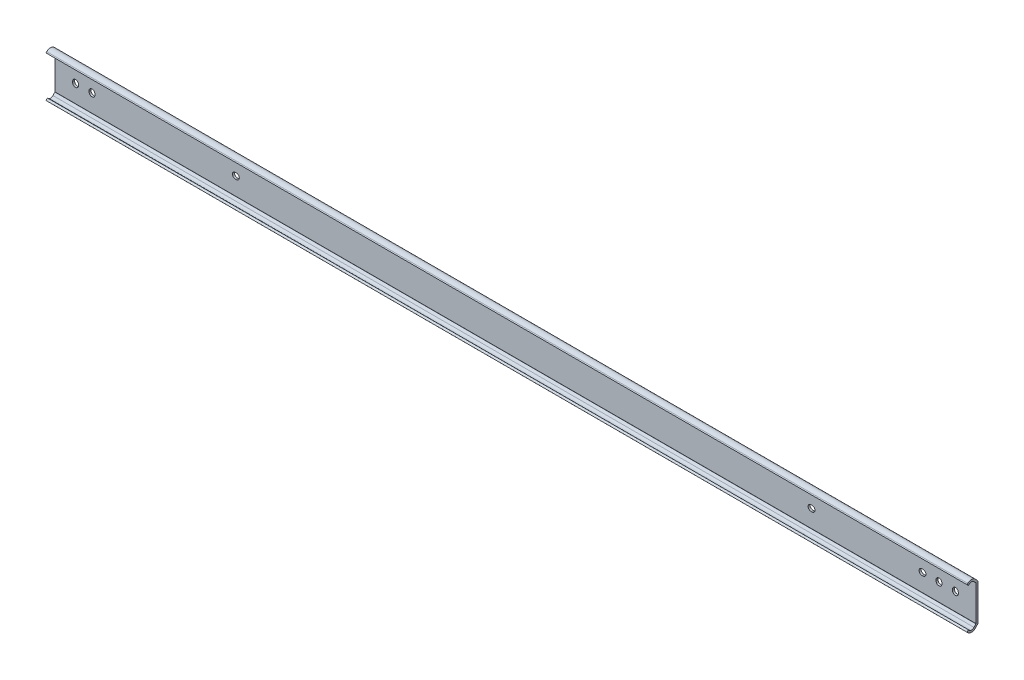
ISO-10303-21;
HEADER;
FILE_DESCRIPTION(('STEP AP214'),'2;1');
FILE_NAME('part.step','',(''),(''),'','','');
FILE_SCHEMA(('AUTOMOTIVE_DESIGN { 1 0 10303 214 1 1 1 1 }'));
ENDSEC;
DATA;
#1=APPLICATION_CONTEXT('core data for automotive mechanical design processes');
#2=APPLICATION_PROTOCOL_DEFINITION('international standard','automotive_design',2000,#1);
#3=PRODUCT_CONTEXT('',#1,'mechanical');
#4=PRODUCT('Part','Part','',(#3));
#5=PRODUCT_RELATED_PRODUCT_CATEGORY('part','',(#4));
#6=PRODUCT_DEFINITION_FORMATION('','',#4);
#7=PRODUCT_DEFINITION_CONTEXT('part definition',#1,'design');
#8=PRODUCT_DEFINITION('design','',#6,#7);
#9=PRODUCT_DEFINITION_SHAPE('','',#8);
#10=(LENGTH_UNIT() NAMED_UNIT(*) SI_UNIT(.MILLI.,.METRE.));
#11=(NAMED_UNIT(*) PLANE_ANGLE_UNIT() SI_UNIT($,.RADIAN.));
#12=(NAMED_UNIT(*) SI_UNIT($,.STERADIAN.) SOLID_ANGLE_UNIT());
#13=UNCERTAINTY_MEASURE_WITH_UNIT(LENGTH_MEASURE(1.E-05),#10,'distance_accuracy_value','');
#14=(GEOMETRIC_REPRESENTATION_CONTEXT(3) GLOBAL_UNCERTAINTY_ASSIGNED_CONTEXT((#13)) GLOBAL_UNIT_ASSIGNED_CONTEXT((#10,
#11,#12)) REPRESENTATION_CONTEXT('',''));
#15=CARTESIAN_POINT('',(0.,0.,0.));
#16=DIRECTION('',(0.,0.,1.));
#17=DIRECTION('',(1.,0.,0.));
#18=AXIS2_PLACEMENT_3D('',#15,#16,#17);
#19=CARTESIAN_POINT('',(-15.9,-13.5610180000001,0.));
#20=DIRECTION('',(0.,0.,-1.));
#21=DIRECTION('',(1.,0.,0.));
#22=AXIS2_PLACEMENT_3D('',#19,#20,#21);
#23=PLANE('',#22);
#24=DIRECTION('',(1.,0.,0.));
#25=VECTOR('',#24,1.);
#26=CARTESIAN_POINT('',(-15.9,13.561018,0.));
#27=LINE('',#26,#25);
#28=CARTESIAN_POINT('',(-15.9,13.561018,0.));
#29=VERTEX_POINT('',#28);
#30=CARTESIAN_POINT('',(695.3,13.561018,0.));
#31=VERTEX_POINT('',#30);
#32=EDGE_CURVE('E668',#29,#31,#27,.T.);
#33=ORIENTED_EDGE('',*,*,#32,.T.);
#34=DIRECTION('',(0.,1.,0.));
#35=VECTOR('',#34,1.);
#36=CARTESIAN_POINT('',(695.3,-13.5610180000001,0.));
#37=LINE('',#36,#35);
#38=CARTESIAN_POINT('',(695.3,-13.5610180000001,0.));
#39=VERTEX_POINT('',#38);
#40=EDGE_CURVE('E602',#39,#31,#37,.T.);
#41=ORIENTED_EDGE('',*,*,#40,.F.);
#42=DIRECTION('',(1.,0.,0.));
#43=VECTOR('',#42,1.);
#44=CARTESIAN_POINT('',(-15.9,-13.5610180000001,0.));
#45=LINE('',#44,#43);
#46=CARTESIAN_POINT('',(-15.9,-13.5610180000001,0.));
#47=VERTEX_POINT('',#46);
#48=EDGE_CURVE('E671',#47,#39,#45,.T.);
#49=ORIENTED_EDGE('',*,*,#48,.F.);
#50=DIRECTION('',(0.,1.,0.));
#51=VECTOR('',#50,1.);
#52=CARTESIAN_POINT('',(-15.9,-13.5610180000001,0.));
#53=LINE('',#52,#51);
#54=EDGE_CURVE('E659',#47,#29,#53,.T.);
#55=ORIENTED_EDGE('',*,*,#54,.T.);
#56=EDGE_LOOP('',(#33,#41,#49,#55));
#57=FACE_BOUND('',#56,.T.);
#58=CARTESIAN_POINT('',(568.7,0.,0.));
#59=DIRECTION('',(0.,0.,-1.));
#60=DIRECTION('',(1.,0.,0.));
#61=AXIS2_PLACEMENT_3D('',#58,#59,#60);
#62=CIRCLE('',#61,2.25);
#63=CARTESIAN_POINT('',(568.7,-2.25,0.));
#64=VERTEX_POINT('',#63);
#65=CARTESIAN_POINT('',(568.7,2.25,0.));
#66=VERTEX_POINT('',#65);
#67=EDGE_CURVE('E341',#64,#66,#62,.F.);
#68=ORIENTED_EDGE('',*,*,#67,.T.);
#69=DIRECTION('',(-1.,0.,0.));
#70=VECTOR('',#69,1.);
#71=CARTESIAN_POINT('',(568.7,2.25,0.));
#72=LINE('',#71,#70);
#73=CARTESIAN_POINT('',(567.9,2.25,0.));
#74=VERTEX_POINT('',#73);
#75=EDGE_CURVE('E353',#66,#74,#72,.T.);
#76=ORIENTED_EDGE('',*,*,#75,.T.);
#77=CARTESIAN_POINT('',(567.9,0.,0.));
#78=DIRECTION('',(0.,0.,-1.));
#79=DIRECTION('',(1.,0.,0.));
#80=AXIS2_PLACEMENT_3D('',#77,#78,#79);
#81=CIRCLE('',#80,2.25);
#82=CARTESIAN_POINT('',(567.9,-2.25,0.));
#83=VERTEX_POINT('',#82);
#84=EDGE_CURVE('E342',#74,#83,#81,.F.);
#85=ORIENTED_EDGE('',*,*,#84,.T.);
#86=DIRECTION('',(1.,0.,0.));
#87=VECTOR('',#86,1.);
#88=CARTESIAN_POINT('',(567.9,-2.25,0.));
#89=LINE('',#88,#87);
#90=EDGE_CURVE('E362',#83,#64,#89,.T.);
#91=ORIENTED_EDGE('',*,*,#90,.T.);
#92=EDGE_LOOP('',(#68,#76,#85,#91));
#93=FACE_BOUND('',#92,.T.);
#94=CARTESIAN_POINT('',(666.7,0.400000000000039,0.));
#95=DIRECTION('',(0.,0.,1.));
#96=DIRECTION('',(1.,0.,0.));
#97=AXIS2_PLACEMENT_3D('',#94,#95,#96);
#98=CIRCLE('',#97,2.24999999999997);
#99=CARTESIAN_POINT('',(668.95,0.400000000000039,0.));
#100=VERTEX_POINT('',#99);
#101=CARTESIAN_POINT('',(664.45,0.400000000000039,0.));
#102=VERTEX_POINT('',#101);
#103=EDGE_CURVE('E532',#100,#102,#98,.T.);
#104=ORIENTED_EDGE('',*,*,#103,.T.);
#105=DIRECTION('',(0.,-1.,0.));
#106=VECTOR('',#105,1.);
#107=CARTESIAN_POINT('',(664.45,0.400000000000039,0.));
#108=LINE('',#107,#106);
#109=CARTESIAN_POINT('',(664.45,-0.400000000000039,0.));
#110=VERTEX_POINT('',#109);
#111=EDGE_CURVE('E535',#102,#110,#108,.T.);
#112=ORIENTED_EDGE('',*,*,#111,.T.);
#113=CARTESIAN_POINT('',(666.7,-0.400000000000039,0.));
#114=DIRECTION('',(0.,0.,1.));
#115=DIRECTION('',(1.,0.,0.));
#116=AXIS2_PLACEMENT_3D('',#113,#114,#115);
#117=CIRCLE('',#116,2.24999999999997);
#118=CARTESIAN_POINT('',(668.95,-0.400000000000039,0.));
#119=VERTEX_POINT('',#118);
#120=EDGE_CURVE('E538',#110,#119,#117,.T.);
#121=ORIENTED_EDGE('',*,*,#120,.T.);
#122=DIRECTION('',(0.,1.,0.));
#123=VECTOR('',#122,1.);
#124=CARTESIAN_POINT('',(668.95,0.400000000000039,0.));
#125=LINE('',#124,#123);
#126=EDGE_CURVE('E541',#119,#100,#125,.T.);
#127=ORIENTED_EDGE('',*,*,#126,.T.);
#128=EDGE_LOOP('',(#104,#112,#121,#127));
#129=FACE_BOUND('',#128,.T.);
#130=CARTESIAN_POINT('',(679.4,0.400000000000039,0.));
#131=DIRECTION('',(0.,0.,1.));
#132=DIRECTION('',(1.,0.,0.));
#133=AXIS2_PLACEMENT_3D('',#130,#131,#132);
#134=CIRCLE('',#133,2.24999999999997);
#135=CARTESIAN_POINT('',(681.65,0.400000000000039,0.));
#136=VERTEX_POINT('',#135);
#137=CARTESIAN_POINT('',(677.15,0.400000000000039,0.));
#138=VERTEX_POINT('',#137);
#139=EDGE_CURVE('E500',#136,#138,#134,.T.);
#140=ORIENTED_EDGE('',*,*,#139,.T.);
#141=DIRECTION('',(0.,-1.,0.));
#142=VECTOR('',#141,1.);
#143=CARTESIAN_POINT('',(677.15,0.400000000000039,0.));
#144=LINE('',#143,#142);
#145=CARTESIAN_POINT('',(677.15,-0.400000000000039,0.));
#146=VERTEX_POINT('',#145);
#147=EDGE_CURVE('E503',#138,#146,#144,.T.);
#148=ORIENTED_EDGE('',*,*,#147,.T.);
#149=CARTESIAN_POINT('',(679.4,-0.400000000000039,0.));
#150=DIRECTION('',(0.,0.,1.));
#151=DIRECTION('',(1.,0.,0.));
#152=AXIS2_PLACEMENT_3D('',#149,#150,#151);
#153=CIRCLE('',#152,2.24999999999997);
#154=CARTESIAN_POINT('',(681.65,-0.400000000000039,0.));
#155=VERTEX_POINT('',#154);
#156=EDGE_CURVE('E506',#146,#155,#153,.T.);
#157=ORIENTED_EDGE('',*,*,#156,.T.);
#158=DIRECTION('',(0.,1.,0.));
#159=VECTOR('',#158,1.);
#160=CARTESIAN_POINT('',(681.65,0.400000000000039,0.));
#161=LINE('',#160,#159);
#162=EDGE_CURVE('E509',#155,#136,#161,.T.);
#163=ORIENTED_EDGE('',*,*,#162,.T.);
#164=EDGE_LOOP('',(#140,#148,#157,#163));
#165=FACE_BOUND('',#164,.T.);
#166=CARTESIAN_POINT('',(0.,0.400000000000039,0.));
#167=DIRECTION('',(0.,0.,1.));
#168=DIRECTION('',(1.,0.,0.));
#169=AXIS2_PLACEMENT_3D('',#166,#167,#168);
#170=CIRCLE('',#169,2.24999999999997);
#171=CARTESIAN_POINT('',(2.24999999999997,0.400000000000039,0.));
#172=VERTEX_POINT('',#171);
#173=CARTESIAN_POINT('',(-2.24999999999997,0.400000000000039,0.));
#174=VERTEX_POINT('',#173);
#175=EDGE_CURVE('E468',#172,#174,#170,.T.);
#176=ORIENTED_EDGE('',*,*,#175,.T.);
#177=DIRECTION('',(0.,-1.,0.));
#178=VECTOR('',#177,1.);
#179=CARTESIAN_POINT('',(-2.24999999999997,0.400000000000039,0.));
#180=LINE('',#179,#178);
#181=CARTESIAN_POINT('',(-2.24999999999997,-0.400000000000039,0.));
#182=VERTEX_POINT('',#181);
#183=EDGE_CURVE('E471',#174,#182,#180,.T.);
#184=ORIENTED_EDGE('',*,*,#183,.T.);
#185=CARTESIAN_POINT('',(0.,-0.400000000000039,0.));
#186=DIRECTION('',(0.,0.,1.));
#187=DIRECTION('',(1.,0.,0.));
#188=AXIS2_PLACEMENT_3D('',#185,#186,#187);
#189=CIRCLE('',#188,2.24999999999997);
#190=CARTESIAN_POINT('',(2.24999999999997,-0.400000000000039,0.));
#191=VERTEX_POINT('',#190);
#192=EDGE_CURVE('E474',#182,#191,#189,.T.);
#193=ORIENTED_EDGE('',*,*,#192,.T.);
#194=DIRECTION('',(0.,1.,0.));
#195=VECTOR('',#194,1.);
#196=CARTESIAN_POINT('',(2.24999999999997,0.400000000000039,0.));
#197=LINE('',#196,#195);
#198=EDGE_CURVE('E477',#191,#172,#197,.T.);
#199=ORIENTED_EDGE('',*,*,#198,.T.);
#200=EDGE_LOOP('',(#176,#184,#193,#199));
#201=FACE_BOUND('',#200,.T.);
#202=CARTESIAN_POINT('',(654.4,0.,0.));
#203=DIRECTION('',(0.,0.,1.));
#204=DIRECTION('',(1.,0.,0.));
#205=AXIS2_PLACEMENT_3D('',#202,#203,#204);
#206=CIRCLE('',#205,2.25);
#207=CARTESIAN_POINT('',(654.4,-2.25,0.));
#208=VERTEX_POINT('',#207);
#209=CARTESIAN_POINT('',(654.4,2.25,0.));
#210=VERTEX_POINT('',#209);
#211=EDGE_CURVE('E436',#208,#210,#206,.T.);
#212=ORIENTED_EDGE('',*,*,#211,.T.);
#213=DIRECTION('',(-1.,0.,0.));
#214=VECTOR('',#213,1.);
#215=CARTESIAN_POINT('',(654.4,2.25,0.));
#216=LINE('',#215,#214);
#217=CARTESIAN_POINT('',(653.6,2.25,0.));
#218=VERTEX_POINT('',#217);
#219=EDGE_CURVE('E439',#210,#218,#216,.T.);
#220=ORIENTED_EDGE('',*,*,#219,.T.);
#221=CARTESIAN_POINT('',(653.6,0.,0.));
#222=DIRECTION('',(0.,0.,1.));
#223=DIRECTION('',(1.,0.,0.));
#224=AXIS2_PLACEMENT_3D('',#221,#222,#223);
#225=CIRCLE('',#224,2.25);
#226=CARTESIAN_POINT('',(653.6,-2.25,0.));
#227=VERTEX_POINT('',#226);
#228=EDGE_CURVE('E442',#218,#227,#225,.T.);
#229=ORIENTED_EDGE('',*,*,#228,.T.);
#230=DIRECTION('',(1.,0.,0.));
#231=VECTOR('',#230,1.);
#232=CARTESIAN_POINT('',(654.4,-2.25,0.));
#233=LINE('',#232,#231);
#234=EDGE_CURVE('E445',#227,#208,#233,.T.);
#235=ORIENTED_EDGE('',*,*,#234,.T.);
#236=EDGE_LOOP('',(#212,#220,#229,#235));
#237=FACE_BOUND('',#236,.T.);
#238=CARTESIAN_POINT('',(12.7,0.400000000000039,0.));
#239=DIRECTION('',(0.,0.,1.));
#240=DIRECTION('',(1.,0.,0.));
#241=AXIS2_PLACEMENT_3D('',#238,#239,#240);
#242=CIRCLE('',#241,2.24999999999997);
#243=CARTESIAN_POINT('',(14.95,0.400000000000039,0.));
#244=VERTEX_POINT('',#243);
#245=CARTESIAN_POINT('',(10.45,0.400000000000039,0.));
#246=VERTEX_POINT('',#245);
#247=EDGE_CURVE('E404',#244,#246,#242,.T.);
#248=ORIENTED_EDGE('',*,*,#247,.T.);
#249=DIRECTION('',(0.,-1.,0.));
#250=VECTOR('',#249,1.);
#251=CARTESIAN_POINT('',(10.45,0.400000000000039,0.));
#252=LINE('',#251,#250);
#253=CARTESIAN_POINT('',(10.45,-0.400000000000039,0.));
#254=VERTEX_POINT('',#253);
#255=EDGE_CURVE('E407',#246,#254,#252,.T.);
#256=ORIENTED_EDGE('',*,*,#255,.T.);
#257=CARTESIAN_POINT('',(12.7,-0.400000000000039,0.));
#258=DIRECTION('',(0.,0.,1.));
#259=DIRECTION('',(1.,0.,0.));
#260=AXIS2_PLACEMENT_3D('',#257,#258,#259);
#261=CIRCLE('',#260,2.24999999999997);
#262=CARTESIAN_POINT('',(14.95,-0.400000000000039,0.));
#263=VERTEX_POINT('',#262);
#264=EDGE_CURVE('E410',#254,#263,#261,.T.);
#265=ORIENTED_EDGE('',*,*,#264,.T.);
#266=DIRECTION('',(0.,1.,0.));
#267=VECTOR('',#266,1.);
#268=CARTESIAN_POINT('',(14.95,0.400000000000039,0.));
#269=LINE('',#268,#267);
#270=EDGE_CURVE('E413',#263,#244,#269,.T.);
#271=ORIENTED_EDGE('',*,*,#270,.T.);
#272=EDGE_LOOP('',(#248,#256,#265,#271));
#273=FACE_BOUND('',#272,.T.);
#274=CARTESIAN_POINT('',(124.2,0.,0.));
#275=DIRECTION('',(0.,0.,1.));
#276=DIRECTION('',(1.,0.,0.));
#277=AXIS2_PLACEMENT_3D('',#274,#275,#276);
#278=CIRCLE('',#277,2.25);
#279=CARTESIAN_POINT('',(124.2,-2.24999999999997,0.));
#280=VERTEX_POINT('',#279);
#281=CARTESIAN_POINT('',(124.2,2.25000000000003,0.));
#282=VERTEX_POINT('',#281);
#283=EDGE_CURVE('E375',#280,#282,#278,.T.);
#284=ORIENTED_EDGE('',*,*,#283,.T.);
#285=DIRECTION('',(-1.,0.,0.));
#286=VECTOR('',#285,1.);
#287=CARTESIAN_POINT('',(124.2,2.25000000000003,0.));
#288=LINE('',#287,#286);
#289=CARTESIAN_POINT('',(123.4,2.25000000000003,0.));
#290=VERTEX_POINT('',#289);
#291=EDGE_CURVE('E378',#282,#290,#288,.T.);
#292=ORIENTED_EDGE('',*,*,#291,.T.);
#293=CARTESIAN_POINT('',(123.4,0.,0.));
#294=DIRECTION('',(0.,0.,1.));
#295=DIRECTION('',(1.,0.,0.));
#296=AXIS2_PLACEMENT_3D('',#293,#294,#295);
#297=CIRCLE('',#296,2.25);
#298=CARTESIAN_POINT('',(123.4,-2.24999999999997,0.));
#299=VERTEX_POINT('',#298);
#300=EDGE_CURVE('E31',#290,#299,#297,.T.);
#301=ORIENTED_EDGE('',*,*,#300,.T.);
#302=DIRECTION('',(1.,0.,0.));
#303=VECTOR('',#302,1.);
#304=CARTESIAN_POINT('',(124.2,-2.24999999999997,0.));
#305=LINE('',#304,#303);
#306=EDGE_CURVE('E382',#299,#280,#305,.T.);
#307=ORIENTED_EDGE('',*,*,#306,.T.);
#308=EDGE_LOOP('',(#284,#292,#301,#307));
#309=FACE_BOUND('',#308,.T.);
#310=ADVANCED_FACE('F14',(#57,#93,#129,#165,#201,#237,#273,#309),#23,.T.);
#311=CARTESIAN_POINT('',(-15.9,13.561018,1.54999999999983));
#312=DIRECTION('',(0.,0.,1.));
#313=DIRECTION('',(-1.,0.,0.));
#314=AXIS2_PLACEMENT_3D('',#311,#312,#313);
#315=PLANE('',#314);
#316=DIRECTION('',(1.,0.,0.));
#317=VECTOR('',#316,1.);
#318=CARTESIAN_POINT('',(-15.9,-13.5610180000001,1.54999999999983));
#319=LINE('',#318,#317);
#320=CARTESIAN_POINT('',(-15.9,-13.5610180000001,1.54999999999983));
#321=VERTEX_POINT('',#320);
#322=CARTESIAN_POINT('',(695.3,-13.5610180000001,1.54999999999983));
#323=VERTEX_POINT('',#322);
#324=EDGE_CURVE('E690',#321,#323,#319,.T.);
#325=ORIENTED_EDGE('',*,*,#324,.T.);
#326=DIRECTION('',(0.,-1.,0.));
#327=VECTOR('',#326,1.);
#328=CARTESIAN_POINT('',(695.3,13.561018,1.54999999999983));
#329=LINE('',#328,#327);
#330=CARTESIAN_POINT('',(695.3,13.561018,1.54999999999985));
#331=VERTEX_POINT('',#330);
#332=EDGE_CURVE('E574',#331,#323,#329,.T.);
#333=ORIENTED_EDGE('',*,*,#332,.F.);
#334=DIRECTION('',(1.,0.,0.));
#335=VECTOR('',#334,1.);
#336=CARTESIAN_POINT('',(-15.9,13.561018,1.54999999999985));
#337=LINE('',#336,#335);
#338=CARTESIAN_POINT('',(-15.9,13.561018,1.54999999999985));
#339=VERTEX_POINT('',#338);
#340=EDGE_CURVE('E693',#339,#331,#337,.T.);
#341=ORIENTED_EDGE('',*,*,#340,.F.);
#342=DIRECTION('',(0.,-1.,0.));
#343=VECTOR('',#342,1.);
#344=CARTESIAN_POINT('',(-15.9,13.561018,1.54999999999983));
#345=LINE('',#344,#343);
#346=EDGE_CURVE('E630',#339,#321,#345,.T.);
#347=ORIENTED_EDGE('',*,*,#346,.T.);
#348=EDGE_LOOP('',(#325,#333,#341,#347));
#349=FACE_BOUND('',#348,.T.);
#350=DIRECTION('',(-1.,0.,0.));
#351=VECTOR('',#350,1.);
#352=CARTESIAN_POINT('',(568.7,2.25,1.54999999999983));
#353=LINE('',#352,#351);
#354=CARTESIAN_POINT('',(568.7,2.25,1.54999999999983));
#355=VERTEX_POINT('',#354);
#356=CARTESIAN_POINT('',(567.9,2.25,1.54999999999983));
#357=VERTEX_POINT('',#356);
#358=EDGE_CURVE('E332',#355,#357,#353,.T.);
#359=ORIENTED_EDGE('',*,*,#358,.F.);
#360=CARTESIAN_POINT('',(568.7,0.,1.54999999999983));
#361=DIRECTION('',(0.,0.,1.));
#362=DIRECTION('',(-1.,0.,0.));
#363=AXIS2_PLACEMENT_3D('',#360,#361,#362);
#364=CIRCLE('',#363,2.25);
#365=CARTESIAN_POINT('',(568.7,-2.25,1.54999999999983));
#366=VERTEX_POINT('',#365);
#367=EDGE_CURVE('E339',#366,#355,#364,.T.);
#368=ORIENTED_EDGE('',*,*,#367,.F.);
#369=DIRECTION('',(1.,0.,0.));
#370=VECTOR('',#369,1.);
#371=CARTESIAN_POINT('',(567.9,-2.25,1.54999999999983));
#372=LINE('',#371,#370);
#373=CARTESIAN_POINT('',(567.9,-2.25,1.54999999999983));
#374=VERTEX_POINT('',#373);
#375=EDGE_CURVE('E321',#374,#366,#372,.T.);
#376=ORIENTED_EDGE('',*,*,#375,.F.);
#377=CARTESIAN_POINT('',(567.9,0.,1.54999999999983));
#378=DIRECTION('',(0.,0.,1.));
#379=DIRECTION('',(-1.,0.,0.));
#380=AXIS2_PLACEMENT_3D('',#377,#378,#379);
#381=CIRCLE('',#380,2.25);
#382=EDGE_CURVE('E333',#357,#374,#381,.T.);
#383=ORIENTED_EDGE('',*,*,#382,.F.);
#384=EDGE_LOOP('',(#359,#368,#376,#383));
#385=FACE_BOUND('',#384,.T.);
#386=CARTESIAN_POINT('',(666.7,0.400000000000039,1.54999999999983));
#387=DIRECTION('',(0.,0.,1.));
#388=DIRECTION('',(1.,0.,0.));
#389=AXIS2_PLACEMENT_3D('',#386,#387,#388);
#390=CIRCLE('',#389,2.24999999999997);
#391=CARTESIAN_POINT('',(668.95,0.400000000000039,1.54999999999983));
#392=VERTEX_POINT('',#391);
#393=CARTESIAN_POINT('',(664.45,0.400000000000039,1.54999999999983));
#394=VERTEX_POINT('',#393);
#395=EDGE_CURVE('E515',#392,#394,#390,.T.);
#396=ORIENTED_EDGE('',*,*,#395,.F.);
#397=DIRECTION('',(0.,1.,0.));
#398=VECTOR('',#397,1.);
#399=CARTESIAN_POINT('',(668.95,0.400000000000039,1.54999999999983));
#400=LINE('',#399,#398);
#401=CARTESIAN_POINT('',(668.95,-0.400000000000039,1.54999999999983));
#402=VERTEX_POINT('',#401);
#403=EDGE_CURVE('E529',#402,#392,#400,.T.);
#404=ORIENTED_EDGE('',*,*,#403,.F.);
#405=CARTESIAN_POINT('',(666.7,-0.400000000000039,1.54999999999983));
#406=DIRECTION('',(0.,0.,1.));
#407=DIRECTION('',(1.,0.,0.));
#408=AXIS2_PLACEMENT_3D('',#405,#406,#407);
#409=CIRCLE('',#408,2.24999999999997);
#410=CARTESIAN_POINT('',(664.45,-0.40000000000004,1.54999999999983));
#411=VERTEX_POINT('',#410);
#412=EDGE_CURVE('E526',#411,#402,#409,.T.);
#413=ORIENTED_EDGE('',*,*,#412,.F.);
#414=DIRECTION('',(0.,-1.,0.));
#415=VECTOR('',#414,1.);
#416=CARTESIAN_POINT('',(664.45,0.400000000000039,1.54999999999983));
#417=LINE('',#416,#415);
#418=EDGE_CURVE('E523',#394,#411,#417,.T.);
#419=ORIENTED_EDGE('',*,*,#418,.F.);
#420=EDGE_LOOP('',(#396,#404,#413,#419));
#421=FACE_BOUND('',#420,.T.);
#422=CARTESIAN_POINT('',(679.4,0.400000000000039,1.54999999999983));
#423=DIRECTION('',(0.,0.,1.));
#424=DIRECTION('',(1.,0.,0.));
#425=AXIS2_PLACEMENT_3D('',#422,#423,#424);
#426=CIRCLE('',#425,2.24999999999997);
#427=CARTESIAN_POINT('',(681.65,0.400000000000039,1.54999999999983));
#428=VERTEX_POINT('',#427);
#429=CARTESIAN_POINT('',(677.15,0.400000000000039,1.54999999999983));
#430=VERTEX_POINT('',#429);
#431=EDGE_CURVE('E483',#428,#430,#426,.T.);
#432=ORIENTED_EDGE('',*,*,#431,.F.);
#433=DIRECTION('',(0.,1.,0.));
#434=VECTOR('',#433,1.);
#435=CARTESIAN_POINT('',(681.65,0.400000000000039,1.54999999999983));
#436=LINE('',#435,#434);
#437=CARTESIAN_POINT('',(681.65,-0.400000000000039,1.54999999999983));
#438=VERTEX_POINT('',#437);
#439=EDGE_CURVE('E497',#438,#428,#436,.T.);
#440=ORIENTED_EDGE('',*,*,#439,.F.);
#441=CARTESIAN_POINT('',(679.4,-0.400000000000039,1.54999999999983));
#442=DIRECTION('',(0.,0.,1.));
#443=DIRECTION('',(1.,0.,0.));
#444=AXIS2_PLACEMENT_3D('',#441,#442,#443);
#445=CIRCLE('',#444,2.24999999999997);
#446=CARTESIAN_POINT('',(677.15,-0.40000000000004,1.54999999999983));
#447=VERTEX_POINT('',#446);
#448=EDGE_CURVE('E494',#447,#438,#445,.T.);
#449=ORIENTED_EDGE('',*,*,#448,.F.);
#450=DIRECTION('',(0.,-1.,0.));
#451=VECTOR('',#450,1.);
#452=CARTESIAN_POINT('',(677.15,0.400000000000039,1.54999999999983));
#453=LINE('',#452,#451);
#454=EDGE_CURVE('E491',#430,#447,#453,.T.);
#455=ORIENTED_EDGE('',*,*,#454,.F.);
#456=EDGE_LOOP('',(#432,#440,#449,#455));
#457=FACE_BOUND('',#456,.T.);
#458=CARTESIAN_POINT('',(0.,0.400000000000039,1.54999999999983));
#459=DIRECTION('',(0.,0.,1.));
#460=DIRECTION('',(1.,0.,0.));
#461=AXIS2_PLACEMENT_3D('',#458,#459,#460);
#462=CIRCLE('',#461,2.24999999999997);
#463=CARTESIAN_POINT('',(2.24999999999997,0.400000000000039,1.54999999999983));
#464=VERTEX_POINT('',#463);
#465=CARTESIAN_POINT('',(-2.24999999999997,0.400000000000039,1.54999999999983));
#466=VERTEX_POINT('',#465);
#467=EDGE_CURVE('E451',#464,#466,#462,.T.);
#468=ORIENTED_EDGE('',*,*,#467,.F.);
#469=DIRECTION('',(0.,1.,0.));
#470=VECTOR('',#469,1.);
#471=CARTESIAN_POINT('',(2.24999999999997,0.400000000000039,1.54999999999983));
#472=LINE('',#471,#470);
#473=CARTESIAN_POINT('',(2.24999999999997,-0.400000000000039,1.54999999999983));
#474=VERTEX_POINT('',#473);
#475=EDGE_CURVE('E465',#474,#464,#472,.T.);
#476=ORIENTED_EDGE('',*,*,#475,.F.);
#477=CARTESIAN_POINT('',(0.,-0.400000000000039,1.54999999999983));
#478=DIRECTION('',(0.,0.,1.));
#479=DIRECTION('',(1.,0.,0.));
#480=AXIS2_PLACEMENT_3D('',#477,#478,#479);
#481=CIRCLE('',#480,2.24999999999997);
#482=CARTESIAN_POINT('',(-2.24999999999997,-0.40000000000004,1.54999999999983));
#483=VERTEX_POINT('',#482);
#484=EDGE_CURVE('E462',#483,#474,#481,.T.);
#485=ORIENTED_EDGE('',*,*,#484,.F.);
#486=DIRECTION('',(0.,-1.,0.));
#487=VECTOR('',#486,1.);
#488=CARTESIAN_POINT('',(-2.24999999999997,0.400000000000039,1.54999999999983));
#489=LINE('',#488,#487);
#490=EDGE_CURVE('E459',#466,#483,#489,.T.);
#491=ORIENTED_EDGE('',*,*,#490,.F.);
#492=EDGE_LOOP('',(#468,#476,#485,#491));
#493=FACE_BOUND('',#492,.T.);
#494=CARTESIAN_POINT('',(654.4,0.,1.54999999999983));
#495=DIRECTION('',(0.,0.,1.));
#496=DIRECTION('',(1.,0.,0.));
#497=AXIS2_PLACEMENT_3D('',#494,#495,#496);
#498=CIRCLE('',#497,2.25);
#499=CARTESIAN_POINT('',(654.4,-2.25,1.54999999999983));
#500=VERTEX_POINT('',#499);
#501=CARTESIAN_POINT('',(654.4,2.25,1.54999999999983));
#502=VERTEX_POINT('',#501);
#503=EDGE_CURVE('E419',#500,#502,#498,.T.);
#504=ORIENTED_EDGE('',*,*,#503,.F.);
#505=DIRECTION('',(1.,0.,0.));
#506=VECTOR('',#505,1.);
#507=CARTESIAN_POINT('',(654.4,-2.25,1.54999999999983));
#508=LINE('',#507,#506);
#509=CARTESIAN_POINT('',(653.6,-2.25,1.54999999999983));
#510=VERTEX_POINT('',#509);
#511=EDGE_CURVE('E433',#510,#500,#508,.T.);
#512=ORIENTED_EDGE('',*,*,#511,.F.);
#513=CARTESIAN_POINT('',(653.6,0.,1.54999999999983));
#514=DIRECTION('',(0.,0.,1.));
#515=DIRECTION('',(1.,0.,0.));
#516=AXIS2_PLACEMENT_3D('',#513,#514,#515);
#517=CIRCLE('',#516,2.25);
#518=CARTESIAN_POINT('',(653.6,2.25,1.54999999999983));
#519=VERTEX_POINT('',#518);
#520=EDGE_CURVE('E430',#519,#510,#517,.T.);
#521=ORIENTED_EDGE('',*,*,#520,.F.);
#522=DIRECTION('',(-1.,0.,0.));
#523=VECTOR('',#522,1.);
#524=CARTESIAN_POINT('',(654.4,2.25,1.54999999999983));
#525=LINE('',#524,#523);
#526=EDGE_CURVE('E427',#502,#519,#525,.T.);
#527=ORIENTED_EDGE('',*,*,#526,.F.);
#528=EDGE_LOOP('',(#504,#512,#521,#527));
#529=FACE_BOUND('',#528,.T.);
#530=CARTESIAN_POINT('',(12.7,0.400000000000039,1.54999999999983));
#531=DIRECTION('',(0.,0.,1.));
#532=DIRECTION('',(1.,0.,0.));
#533=AXIS2_PLACEMENT_3D('',#530,#531,#532);
#534=CIRCLE('',#533,2.24999999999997);
#535=CARTESIAN_POINT('',(14.95,0.400000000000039,1.54999999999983));
#536=VERTEX_POINT('',#535);
#537=CARTESIAN_POINT('',(10.45,0.400000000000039,1.54999999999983));
#538=VERTEX_POINT('',#537);
#539=EDGE_CURVE('E388',#536,#538,#534,.T.);
#540=ORIENTED_EDGE('',*,*,#539,.F.);
#541=DIRECTION('',(0.,1.,0.));
#542=VECTOR('',#541,1.);
#543=CARTESIAN_POINT('',(14.95,0.400000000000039,1.54999999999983));
#544=LINE('',#543,#542);
#545=CARTESIAN_POINT('',(14.95,-0.400000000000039,1.54999999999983));
#546=VERTEX_POINT('',#545);
#547=EDGE_CURVE('E401',#546,#536,#544,.T.);
#548=ORIENTED_EDGE('',*,*,#547,.F.);
#549=CARTESIAN_POINT('',(12.7,-0.400000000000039,1.54999999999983));
#550=DIRECTION('',(0.,0.,1.));
#551=DIRECTION('',(1.,0.,0.));
#552=AXIS2_PLACEMENT_3D('',#549,#550,#551);
#553=CIRCLE('',#552,2.24999999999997);
#554=CARTESIAN_POINT('',(10.45,-0.40000000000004,1.54999999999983));
#555=VERTEX_POINT('',#554);
#556=EDGE_CURVE('E398',#555,#546,#553,.T.);
#557=ORIENTED_EDGE('',*,*,#556,.F.);
#558=DIRECTION('',(0.,-1.,0.));
#559=VECTOR('',#558,1.);
#560=CARTESIAN_POINT('',(10.45,0.400000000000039,1.54999999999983));
#561=LINE('',#560,#559);
#562=EDGE_CURVE('E395',#538,#555,#561,.T.);
#563=ORIENTED_EDGE('',*,*,#562,.F.);
#564=EDGE_LOOP('',(#540,#548,#557,#563));
#565=FACE_BOUND('',#564,.T.);
#566=CARTESIAN_POINT('',(124.2,0.,1.54999999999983));
#567=DIRECTION('',(0.,0.,1.));
#568=DIRECTION('',(1.,0.,0.));
#569=AXIS2_PLACEMENT_3D('',#566,#567,#568);
#570=CIRCLE('',#569,2.25);
#571=CARTESIAN_POINT('',(124.2,-2.24999999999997,1.54999999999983));
#572=VERTEX_POINT('',#571);
#573=CARTESIAN_POINT('',(124.2,2.25000000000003,1.54999999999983));
#574=VERTEX_POINT('',#573);
#575=EDGE_CURVE('E39',#572,#574,#570,.T.);
#576=ORIENTED_EDGE('',*,*,#575,.F.);
#577=DIRECTION('',(1.,0.,0.));
#578=VECTOR('',#577,1.);
#579=CARTESIAN_POINT('',(124.2,-2.24999999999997,1.54999999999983));
#580=LINE('',#579,#578);
#581=CARTESIAN_POINT('',(123.4,-2.24999999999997,1.54999999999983));
#582=VERTEX_POINT('',#581);
#583=EDGE_CURVE('E372',#582,#572,#580,.T.);
#584=ORIENTED_EDGE('',*,*,#583,.F.);
#585=CARTESIAN_POINT('',(123.4,0.,1.54999999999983));
#586=DIRECTION('',(0.,0.,1.));
#587=DIRECTION('',(1.,0.,0.));
#588=AXIS2_PLACEMENT_3D('',#585,#586,#587);
#589=CIRCLE('',#588,2.25);
#590=CARTESIAN_POINT('',(123.4,2.25000000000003,1.54999999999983));
#591=VERTEX_POINT('',#590);
#592=EDGE_CURVE('E369',#591,#582,#589,.T.);
#593=ORIENTED_EDGE('',*,*,#592,.F.);
#594=DIRECTION('',(-1.,0.,0.));
#595=VECTOR('',#594,1.);
#596=CARTESIAN_POINT('',(124.2,2.25000000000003,1.54999999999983));
#597=LINE('',#596,#595);
#598=EDGE_CURVE('E366',#574,#591,#597,.T.);
#599=ORIENTED_EDGE('',*,*,#598,.F.);
#600=EDGE_LOOP('',(#576,#584,#593,#599));
#601=FACE_BOUND('',#600,.T.);
#602=ADVANCED_FACE('F345',(#349,#385,#421,#457,#493,#529,#565,#601),#315,.T.);
#603=CARTESIAN_POINT('',(695.3,13.575,5.00000000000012));
#604=DIRECTION('',(-1.,0.,0.));
#605=DIRECTION('',(0.,0.,-1.));
#606=AXIS2_PLACEMENT_3D('',#603,#604,#605);
#607=PLANE('',#606);
#608=ORIENTED_EDGE('',*,*,#40,.T.);
#609=CARTESIAN_POINT('',(695.3,13.5610179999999,1.80000000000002));
#610=DIRECTION('',(1.,0.,0.));
#611=DIRECTION('',(0.,0.,-1.));
#612=AXIS2_PLACEMENT_3D('',#609,#610,#611);
#613=CIRCLE('',#612,1.8);
#614=CARTESIAN_POINT('',(695.3,14.8073560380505,0.501292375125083));
#615=VERTEX_POINT('',#614);
#616=EDGE_CURVE('E604',#31,#615,#613,.T.);
#617=ORIENTED_EDGE('',*,*,#616,.T.);
#618=DIRECTION('',(0.,0.721504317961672,0.692409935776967));
#619=VECTOR('',#618,1.);
#620=CARTESIAN_POINT('',(695.3,14.8073560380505,0.501292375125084));
#621=LINE('',#620,#619);
#622=CARTESIAN_POINT('',(695.3,16.4741282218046,2.10085261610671));
#623=VERTEX_POINT('',#622);
#624=EDGE_CURVE('E607',#615,#623,#621,.T.);
#625=ORIENTED_EDGE('',*,*,#624,.T.);
#626=CARTESIAN_POINT('',(695.3,13.575,5.00000000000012));
#627=DIRECTION('',(1.,0.,0.));
#628=DIRECTION('',(0.,0.,-1.));
#629=AXIS2_PLACEMENT_3D('',#626,#627,#628);
#630=CIRCLE('',#629,4.1);
#631=CARTESIAN_POINT('',(695.3,16.4741282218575,7.89914738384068));
#632=VERTEX_POINT('',#631);
#633=EDGE_CURVE('E547',#623,#632,#630,.T.);
#634=ORIENTED_EDGE('',*,*,#633,.T.);
#635=DIRECTION('',(0.,-0.721504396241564,0.692409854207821));
#636=VECTOR('',#635,1.);
#637=CARTESIAN_POINT('',(695.3,15.8897090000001,8.45999999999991));
#638=LINE('',#637,#636);
#639=CARTESIAN_POINT('',(695.3,15.8897090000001,8.45999999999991));
#640=VERTEX_POINT('',#639);
#641=EDGE_CURVE('E556',#632,#640,#638,.T.);
#642=ORIENTED_EDGE('',*,*,#641,.T.);
#643=DIRECTION('',(0.,-0.707106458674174,-0.707107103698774));
#644=VECTOR('',#643,1.);
#645=CARTESIAN_POINT('',(695.3,14.793462,7.363752));
#646=LINE('',#645,#644);
#647=CARTESIAN_POINT('',(695.3,14.793462,7.363752));
#648=VERTEX_POINT('',#647);
#649=EDGE_CURVE('E559',#640,#648,#646,.T.);
#650=ORIENTED_EDGE('',*,*,#649,.T.);
#651=DIRECTION('',(0.,0.721503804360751,-0.692410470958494));
#652=VECTOR('',#651,1.);
#653=CARTESIAN_POINT('',(695.3,15.3880487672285,6.79314086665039));
#654=LINE('',#653,#652);
#655=CARTESIAN_POINT('',(695.3,15.3880487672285,6.79314086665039));
#656=VERTEX_POINT('',#655);
#657=EDGE_CURVE('E562',#648,#656,#654,.T.);
#658=ORIENTED_EDGE('',*,*,#657,.T.);
#659=CARTESIAN_POINT('',(695.3,13.575,5.00000000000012));
#660=DIRECTION('',(-1.,0.,0.));
#661=DIRECTION('',(0.,0.,1.));
#662=AXIS2_PLACEMENT_3D('',#659,#660,#661);
#663=CIRCLE('',#662,2.55);
#664=CARTESIAN_POINT('',(695.3,15.2920682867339,3.11474762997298));
#665=VERTEX_POINT('',#664);
#666=EDGE_CURVE('E565',#656,#665,#663,.T.);
#667=ORIENTED_EDGE('',*,*,#666,.T.);
#668=DIRECTION('',(0.,-0.721504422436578,-0.692409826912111));
#669=VECTOR('',#668,1.);
#670=CARTESIAN_POINT('',(695.3,13.7341205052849,1.61962394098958));
#671=LINE('',#670,#669);
#672=CARTESIAN_POINT('',(695.3,13.7341205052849,1.61962394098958));
#673=VERTEX_POINT('',#672);
#674=EDGE_CURVE('E568',#665,#673,#671,.T.);
#675=ORIENTED_EDGE('',*,*,#674,.T.);
#676=CARTESIAN_POINT('',(695.3,13.5610179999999,1.80000000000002));
#677=DIRECTION('',(-1.,0.,0.));
#678=DIRECTION('',(0.,0.,1.));
#679=AXIS2_PLACEMENT_3D('',#676,#677,#678);
#680=CIRCLE('',#679,0.250000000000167);
#681=EDGE_CURVE('E571',#673,#331,#680,.T.);
#682=ORIENTED_EDGE('',*,*,#681,.T.);
#683=ORIENTED_EDGE('',*,*,#332,.T.);
#684=CARTESIAN_POINT('',(695.3,-13.561018,1.80000000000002));
#685=DIRECTION('',(-1.,0.,0.));
#686=DIRECTION('',(0.,0.,-1.));
#687=AXIS2_PLACEMENT_3D('',#684,#685,#686);
#688=CIRCLE('',#687,0.250000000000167);
#689=CARTESIAN_POINT('',(695.3,-13.734120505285,1.61962394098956));
#690=VERTEX_POINT('',#689);
#691=EDGE_CURVE('E576',#323,#690,#688,.T.);
#692=ORIENTED_EDGE('',*,*,#691,.T.);
#693=DIRECTION('',(0.,-0.721504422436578,0.692409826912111));
#694=VECTOR('',#693,1.);
#695=CARTESIAN_POINT('',(695.3,-13.734120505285,1.61962394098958));
#696=LINE('',#695,#694);
#697=CARTESIAN_POINT('',(695.3,-15.292068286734,3.11474762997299));
#698=VERTEX_POINT('',#697);
#699=EDGE_CURVE('E579',#690,#698,#696,.T.);
#700=ORIENTED_EDGE('',*,*,#699,.T.);
#701=CARTESIAN_POINT('',(695.3,-13.5750000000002,5.00000000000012));
#702=DIRECTION('',(-1.,0.,0.));
#703=DIRECTION('',(0.,0.,-1.));
#704=AXIS2_PLACEMENT_3D('',#701,#702,#703);
#705=CIRCLE('',#704,2.55);
#706=CARTESIAN_POINT('',(695.3,-15.3880487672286,6.79314086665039));
#707=VERTEX_POINT('',#706);
#708=EDGE_CURVE('E582',#698,#707,#705,.T.);
#709=ORIENTED_EDGE('',*,*,#708,.T.);
#710=DIRECTION('',(0.,0.721503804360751,0.692410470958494));
#711=VECTOR('',#710,1.);
#712=CARTESIAN_POINT('',(695.3,-15.3880487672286,6.79314086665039));
#713=LINE('',#712,#711);
#714=CARTESIAN_POINT('',(695.3,-14.7934620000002,7.363752));
#715=VERTEX_POINT('',#714);
#716=EDGE_CURVE('E585',#707,#715,#713,.T.);
#717=ORIENTED_EDGE('',*,*,#716,.T.);
#718=DIRECTION('',(0.,-0.707106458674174,0.707107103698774));
#719=VECTOR('',#718,1.);
#720=CARTESIAN_POINT('',(695.3,-14.7934620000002,7.363752));
#721=LINE('',#720,#719);
#722=CARTESIAN_POINT('',(695.3,-15.8897090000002,8.45999999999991));
#723=VERTEX_POINT('',#722);
#724=EDGE_CURVE('E588',#715,#723,#721,.T.);
#725=ORIENTED_EDGE('',*,*,#724,.T.);
#726=DIRECTION('',(0.,-0.721504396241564,-0.692409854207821));
#727=VECTOR('',#726,1.);
#728=CARTESIAN_POINT('',(695.3,-15.8897090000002,8.45999999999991));
#729=LINE('',#728,#727);
#730=CARTESIAN_POINT('',(695.3,-16.4741282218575,7.89914738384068));
#731=VERTEX_POINT('',#730);
#732=EDGE_CURVE('E591',#723,#731,#729,.T.);
#733=ORIENTED_EDGE('',*,*,#732,.T.);
#734=CARTESIAN_POINT('',(695.3,-13.5750000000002,5.00000000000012));
#735=DIRECTION('',(1.,0.,0.));
#736=DIRECTION('',(0.,0.,1.));
#737=AXIS2_PLACEMENT_3D('',#734,#735,#736);
#738=CIRCLE('',#737,4.1);
#739=CARTESIAN_POINT('',(695.3,-16.4741282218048,2.10085261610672));
#740=VERTEX_POINT('',#739);
#741=EDGE_CURVE('E594',#731,#740,#738,.T.);
#742=ORIENTED_EDGE('',*,*,#741,.T.);
#743=DIRECTION('',(0.,0.721504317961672,-0.692409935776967));
#744=VECTOR('',#743,1.);
#745=CARTESIAN_POINT('',(695.3,-14.8073560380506,0.501292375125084));
#746=LINE('',#745,#744);
#747=CARTESIAN_POINT('',(695.3,-14.8073560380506,0.501292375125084));
#748=VERTEX_POINT('',#747);
#749=EDGE_CURVE('E597',#740,#748,#746,.T.);
#750=ORIENTED_EDGE('',*,*,#749,.T.);
#751=CARTESIAN_POINT('',(695.3,-13.561018,1.80000000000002));
#752=DIRECTION('',(1.,0.,0.));
#753=DIRECTION('',(0.,0.,1.));
#754=AXIS2_PLACEMENT_3D('',#751,#752,#753);
#755=CIRCLE('',#754,1.8);
#756=EDGE_CURVE('E599',#748,#39,#755,.T.);
#757=ORIENTED_EDGE('',*,*,#756,.T.);
#758=EDGE_LOOP('',(#608,#617,#625,#634,#642,#650,#658,#667,#675,#682,#683,#692,#700,#709,#717,
#725,#733,#742,#750,#757));
#759=FACE_BOUND('',#758,.T.);
#760=ADVANCED_FACE('F713',(#759),#607,.F.);
#761=CARTESIAN_POINT('',(-15.9,13.575,5.00000000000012));
#762=DIRECTION('',(1.,0.,0.));
#763=DIRECTION('',(0.,0.,1.));
#764=AXIS2_PLACEMENT_3D('',#761,#762,#763);
#765=CYLINDRICAL_SURFACE('',#764,4.1);
#766=ORIENTED_EDGE('',*,*,#633,.F.);
#767=DIRECTION('',(1.,0.,0.));
#768=VECTOR('',#767,1.);
#769=CARTESIAN_POINT('',(-15.9,16.4741282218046,2.10085261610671));
#770=LINE('',#769,#768);
#771=CARTESIAN_POINT('',(-15.9,16.4741282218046,2.10085261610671));
#772=VERTEX_POINT('',#771);
#773=EDGE_CURVE('E9',#772,#623,#770,.T.);
#774=ORIENTED_EDGE('',*,*,#773,.F.);
#775=CARTESIAN_POINT('',(-15.9,13.575,5.00000000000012));
#776=DIRECTION('',(1.,0.,0.));
#777=DIRECTION('',(0.,0.,-1.));
#778=AXIS2_PLACEMENT_3D('',#775,#776,#777);
#779=CIRCLE('',#778,4.1);
#780=CARTESIAN_POINT('',(-15.9,16.4741282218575,7.89914738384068));
#781=VERTEX_POINT('',#780);
#782=EDGE_CURVE('E609',#772,#781,#779,.T.);
#783=ORIENTED_EDGE('',*,*,#782,.T.);
#784=DIRECTION('',(1.,0.,0.));
#785=VECTOR('',#784,1.);
#786=CARTESIAN_POINT('',(-15.9,16.4741282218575,7.89914738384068));
#787=LINE('',#786,#785);
#788=EDGE_CURVE('E18',#781,#632,#787,.T.);
#789=ORIENTED_EDGE('',*,*,#788,.T.);
#790=EDGE_LOOP('',(#766,#774,#783,#789));
#791=FACE_BOUND('',#790,.T.);
#792=ADVANCED_FACE('F16',(#791),#765,.T.);
#793=CARTESIAN_POINT('',(-15.9,14.8073560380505,0.501292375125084));
#794=DIRECTION('',(0.,0.692409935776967,-0.721504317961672));
#795=DIRECTION('',(0.,0.721504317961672,0.692409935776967));
#796=AXIS2_PLACEMENT_3D('',#793,#794,#795);
#797=PLANE('',#796);
#798=ORIENTED_EDGE('',*,*,#624,.F.);
#799=DIRECTION('',(1.,0.,0.));
#800=VECTOR('',#799,1.);
#801=CARTESIAN_POINT('',(-15.9,14.8073560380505,0.501292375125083));
#802=LINE('',#801,#800);
#803=CARTESIAN_POINT('',(-15.9,14.8073560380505,0.501292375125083));
#804=VERTEX_POINT('',#803);
#805=EDGE_CURVE('E23',#804,#615,#802,.T.);
#806=ORIENTED_EDGE('',*,*,#805,.F.);
#807=DIRECTION('',(0.,0.721504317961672,0.692409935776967));
#808=VECTOR('',#807,1.);
#809=CARTESIAN_POINT('',(-15.9,14.8073560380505,0.501292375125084));
#810=LINE('',#809,#808);
#811=EDGE_CURVE('E665',#804,#772,#810,.T.);
#812=ORIENTED_EDGE('',*,*,#811,.T.);
#813=ORIENTED_EDGE('',*,*,#773,.T.);
#814=EDGE_LOOP('',(#798,#806,#812,#813));
#815=FACE_BOUND('',#814,.T.);
#816=ADVANCED_FACE('F717',(#815),#797,.T.);
#817=CARTESIAN_POINT('',(-15.9,13.5610179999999,1.80000000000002));
#818=DIRECTION('',(1.,0.,0.));
#819=DIRECTION('',(0.,0.,1.));
#820=AXIS2_PLACEMENT_3D('',#817,#818,#819);
#821=CYLINDRICAL_SURFACE('',#820,1.8);
#822=ORIENTED_EDGE('',*,*,#616,.F.);
#823=ORIENTED_EDGE('',*,*,#32,.F.);
#824=CARTESIAN_POINT('',(-15.9,13.5610179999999,1.80000000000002));
#825=DIRECTION('',(1.,0.,0.));
#826=DIRECTION('',(0.,0.,-1.));
#827=AXIS2_PLACEMENT_3D('',#824,#825,#826);
#828=CIRCLE('',#827,1.8);
#829=EDGE_CURVE('E662',#29,#804,#828,.T.);
#830=ORIENTED_EDGE('',*,*,#829,.T.);
#831=ORIENTED_EDGE('',*,*,#805,.T.);
#832=EDGE_LOOP('',(#822,#823,#830,#831));
#833=FACE_BOUND('',#832,.T.);
#834=ADVANCED_FACE('F786',(#833),#821,.T.);
#835=CARTESIAN_POINT('',(-15.9,-13.561018,1.80000000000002));
#836=DIRECTION('',(1.,0.,0.));
#837=DIRECTION('',(0.,0.,1.));
#838=AXIS2_PLACEMENT_3D('',#835,#836,#837);
#839=CYLINDRICAL_SURFACE('',#838,1.8);
#840=ORIENTED_EDGE('',*,*,#756,.F.);
#841=DIRECTION('',(1.,0.,0.));
#842=VECTOR('',#841,1.);
#843=CARTESIAN_POINT('',(-15.9,-14.8073560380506,0.501292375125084));
#844=LINE('',#843,#842);
#845=CARTESIAN_POINT('',(-15.9,-14.8073560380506,0.501292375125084));
#846=VERTEX_POINT('',#845);
#847=EDGE_CURVE('E673',#846,#748,#844,.T.);
#848=ORIENTED_EDGE('',*,*,#847,.F.);
#849=CARTESIAN_POINT('',(-15.9,-13.561018,1.80000000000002));
#850=DIRECTION('',(1.,0.,0.));
#851=DIRECTION('',(0.,0.,1.));
#852=AXIS2_PLACEMENT_3D('',#849,#850,#851);
#853=CIRCLE('',#852,1.8);
#854=EDGE_CURVE('E656',#846,#47,#853,.T.);
#855=ORIENTED_EDGE('',*,*,#854,.T.);
#856=ORIENTED_EDGE('',*,*,#48,.T.);
#857=EDGE_LOOP('',(#840,#848,#855,#856));
#858=FACE_BOUND('',#857,.T.);
#859=ADVANCED_FACE('F780',(#858),#839,.T.);
#860=CARTESIAN_POINT('',(-15.9,-14.8073560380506,0.501292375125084));
#861=DIRECTION('',(0.,-0.692409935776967,-0.721504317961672));
#862=DIRECTION('',(0.,0.721504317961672,-0.692409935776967));
#863=AXIS2_PLACEMENT_3D('',#860,#861,#862);
#864=PLANE('',#863);
#865=ORIENTED_EDGE('',*,*,#749,.F.);
#866=DIRECTION('',(1.,0.,0.));
#867=VECTOR('',#866,1.);
#868=CARTESIAN_POINT('',(-15.9,-16.4741282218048,2.10085261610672));
#869=LINE('',#868,#867);
#870=CARTESIAN_POINT('',(-15.9,-16.4741282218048,2.10085261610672));
#871=VERTEX_POINT('',#870);
#872=EDGE_CURVE('E676',#871,#740,#869,.T.);
#873=ORIENTED_EDGE('',*,*,#872,.F.);
#874=DIRECTION('',(0.,0.721504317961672,-0.692409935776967));
#875=VECTOR('',#874,1.);
#876=CARTESIAN_POINT('',(-15.9,-14.8073560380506,0.501292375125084));
#877=LINE('',#876,#875);
#878=EDGE_CURVE('E654',#871,#846,#877,.T.);
#879=ORIENTED_EDGE('',*,*,#878,.T.);
#880=ORIENTED_EDGE('',*,*,#847,.T.);
#881=EDGE_LOOP('',(#865,#873,#879,#880));
#882=FACE_BOUND('',#881,.T.);
#883=ADVANCED_FACE('F776',(#882),#864,.T.);
#884=CARTESIAN_POINT('',(-15.9,-13.5750000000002,5.00000000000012));
#885=DIRECTION('',(1.,0.,0.));
#886=DIRECTION('',(0.,0.,1.));
#887=AXIS2_PLACEMENT_3D('',#884,#885,#886);
#888=CYLINDRICAL_SURFACE('',#887,4.1);
#889=ORIENTED_EDGE('',*,*,#741,.F.);
#890=DIRECTION('',(1.,0.,0.));
#891=VECTOR('',#890,1.);
#892=CARTESIAN_POINT('',(-15.9,-16.4741282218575,7.89914738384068));
#893=LINE('',#892,#891);
#894=CARTESIAN_POINT('',(-15.9,-16.4741282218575,7.89914738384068));
#895=VERTEX_POINT('',#894);
#896=EDGE_CURVE('E678',#895,#731,#893,.T.);
#897=ORIENTED_EDGE('',*,*,#896,.F.);
#898=CARTESIAN_POINT('',(-15.9,-13.5750000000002,5.00000000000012));
#899=DIRECTION('',(1.,0.,0.));
#900=DIRECTION('',(0.,0.,1.));
#901=AXIS2_PLACEMENT_3D('',#898,#899,#900);
#902=CIRCLE('',#901,4.1);
#903=EDGE_CURVE('E651',#895,#871,#902,.T.);
#904=ORIENTED_EDGE('',*,*,#903,.T.);
#905=ORIENTED_EDGE('',*,*,#872,.T.);
#906=EDGE_LOOP('',(#889,#897,#904,#905));
#907=FACE_BOUND('',#906,.T.);
#908=ADVANCED_FACE('F771',(#907),#888,.T.);
#909=CARTESIAN_POINT('',(-15.9,-15.8897090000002,8.45999999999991));
#910=DIRECTION('',(0.,-0.692409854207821,0.721504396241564));
#911=DIRECTION('',(0.,-0.721504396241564,-0.692409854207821));
#912=AXIS2_PLACEMENT_3D('',#909,#910,#911);
#913=PLANE('',#912);
#914=ORIENTED_EDGE('',*,*,#732,.F.);
#915=DIRECTION('',(1.,0.,0.));
#916=VECTOR('',#915,1.);
#917=CARTESIAN_POINT('',(-15.9,-15.8897090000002,8.45999999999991));
#918=LINE('',#917,#916);
#919=CARTESIAN_POINT('',(-15.9,-15.8897090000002,8.45999999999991));
#920=VERTEX_POINT('',#919);
#921=EDGE_CURVE('E680',#920,#723,#918,.T.);
#922=ORIENTED_EDGE('',*,*,#921,.F.);
#923=DIRECTION('',(0.,-0.721504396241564,-0.692409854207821));
#924=VECTOR('',#923,1.);
#925=CARTESIAN_POINT('',(-15.9,-15.8897090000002,8.45999999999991));
#926=LINE('',#925,#924);
#927=EDGE_CURVE('E648',#920,#895,#926,.T.);
#928=ORIENTED_EDGE('',*,*,#927,.T.);
#929=ORIENTED_EDGE('',*,*,#896,.T.);
#930=EDGE_LOOP('',(#914,#922,#928,#929));
#931=FACE_BOUND('',#930,.T.);
#932=ADVANCED_FACE('F767',(#931),#913,.T.);
#933=CARTESIAN_POINT('',(-15.9,-14.7934620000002,7.363752));
#934=DIRECTION('',(0.,0.707107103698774,0.707106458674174));
#935=DIRECTION('',(0.,-0.707106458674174,0.707107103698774));
#936=AXIS2_PLACEMENT_3D('',#933,#934,#935);
#937=PLANE('',#936);
#938=ORIENTED_EDGE('',*,*,#724,.F.);
#939=DIRECTION('',(1.,0.,0.));
#940=VECTOR('',#939,1.);
#941=CARTESIAN_POINT('',(-15.9,-14.7934620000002,7.363752));
#942=LINE('',#941,#940);
#943=CARTESIAN_POINT('',(-15.9,-14.7934620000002,7.363752));
#944=VERTEX_POINT('',#943);
#945=EDGE_CURVE('E682',#944,#715,#942,.T.);
#946=ORIENTED_EDGE('',*,*,#945,.F.);
#947=DIRECTION('',(0.,-0.707106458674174,0.707107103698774));
#948=VECTOR('',#947,1.);
#949=CARTESIAN_POINT('',(-15.9,-14.7934620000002,7.363752));
#950=LINE('',#949,#948);
#951=EDGE_CURVE('E645',#944,#920,#950,.T.);
#952=ORIENTED_EDGE('',*,*,#951,.T.);
#953=ORIENTED_EDGE('',*,*,#921,.T.);
#954=EDGE_LOOP('',(#938,#946,#952,#953));
#955=FACE_BOUND('',#954,.T.);
#956=ADVANCED_FACE('F763',(#955),#937,.T.);
#957=CARTESIAN_POINT('',(-15.9,-15.3880487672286,6.79314086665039));
#958=DIRECTION('',(0.,0.692410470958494,-0.721503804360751));
#959=DIRECTION('',(0.,0.721503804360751,0.692410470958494));
#960=AXIS2_PLACEMENT_3D('',#957,#958,#959);
#961=PLANE('',#960);
#962=ORIENTED_EDGE('',*,*,#716,.F.);
#963=DIRECTION('',(1.,0.,0.));
#964=VECTOR('',#963,1.);
#965=CARTESIAN_POINT('',(-15.9,-15.3880487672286,6.79314086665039));
#966=LINE('',#965,#964);
#967=CARTESIAN_POINT('',(-15.9,-15.3880487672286,6.79314086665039));
#968=VERTEX_POINT('',#967);
#969=EDGE_CURVE('E684',#968,#707,#966,.T.);
#970=ORIENTED_EDGE('',*,*,#969,.F.);
#971=DIRECTION('',(0.,0.721503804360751,0.692410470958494));
#972=VECTOR('',#971,1.);
#973=CARTESIAN_POINT('',(-15.9,-15.3880487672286,6.79314086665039));
#974=LINE('',#973,#972);
#975=EDGE_CURVE('E642',#968,#944,#974,.T.);
#976=ORIENTED_EDGE('',*,*,#975,.T.);
#977=ORIENTED_EDGE('',*,*,#945,.T.);
#978=EDGE_LOOP('',(#962,#970,#976,#977));
#979=FACE_BOUND('',#978,.T.);
#980=ADVANCED_FACE('F759',(#979),#961,.T.);
#981=CARTESIAN_POINT('',(-15.9,-13.5750000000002,5.00000000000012));
#982=DIRECTION('',(1.,0.,0.));
#983=DIRECTION('',(0.,0.,1.));
#984=AXIS2_PLACEMENT_3D('',#981,#982,#983);
#985=CYLINDRICAL_SURFACE('',#984,2.55);
#986=ORIENTED_EDGE('',*,*,#708,.F.);
#987=DIRECTION('',(1.,0.,0.));
#988=VECTOR('',#987,1.);
#989=CARTESIAN_POINT('',(-15.9,-15.292068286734,3.11474762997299));
#990=LINE('',#989,#988);
#991=CARTESIAN_POINT('',(-15.9,-15.292068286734,3.11474762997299));
#992=VERTEX_POINT('',#991);
#993=EDGE_CURVE('E686',#992,#698,#990,.T.);
#994=ORIENTED_EDGE('',*,*,#993,.F.);
#995=CARTESIAN_POINT('',(-15.9,-13.5750000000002,5.00000000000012));
#996=DIRECTION('',(-1.,0.,0.));
#997=DIRECTION('',(0.,0.,-1.));
#998=AXIS2_PLACEMENT_3D('',#995,#996,#997);
#999=CIRCLE('',#998,2.55);
#1000=EDGE_CURVE('E639',#992,#968,#999,.T.);
#1001=ORIENTED_EDGE('',*,*,#1000,.T.);
#1002=ORIENTED_EDGE('',*,*,#969,.T.);
#1003=EDGE_LOOP('',(#986,#994,#1001,#1002));
#1004=FACE_BOUND('',#1003,.T.);
#1005=ADVANCED_FACE('F755',(#1004),#985,.F.);
#1006=CARTESIAN_POINT('',(-15.9,-13.734120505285,1.61962394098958));
#1007=DIRECTION('',(0.,0.692409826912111,0.721504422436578));
#1008=DIRECTION('',(0.,-0.721504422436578,0.692409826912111));
#1009=AXIS2_PLACEMENT_3D('',#1006,#1007,#1008);
#1010=PLANE('',#1009);
#1011=ORIENTED_EDGE('',*,*,#699,.F.);
#1012=DIRECTION('',(1.,0.,0.));
#1013=VECTOR('',#1012,1.);
#1014=CARTESIAN_POINT('',(-15.9,-13.734120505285,1.61962394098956));
#1015=LINE('',#1014,#1013);
#1016=CARTESIAN_POINT('',(-15.9,-13.734120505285,1.61962394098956));
#1017=VERTEX_POINT('',#1016);
#1018=EDGE_CURVE('E688',#1017,#690,#1015,.T.);
#1019=ORIENTED_EDGE('',*,*,#1018,.F.);
#1020=DIRECTION('',(0.,-0.721504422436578,0.692409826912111));
#1021=VECTOR('',#1020,1.);
#1022=CARTESIAN_POINT('',(-15.9,-13.734120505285,1.61962394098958));
#1023=LINE('',#1022,#1021);
#1024=EDGE_CURVE('E636',#1017,#992,#1023,.T.);
#1025=ORIENTED_EDGE('',*,*,#1024,.T.);
#1026=ORIENTED_EDGE('',*,*,#993,.T.);
#1027=EDGE_LOOP('',(#1011,#1019,#1025,#1026));
#1028=FACE_BOUND('',#1027,.T.);
#1029=ADVANCED_FACE('F751',(#1028),#1010,.T.);
#1030=CARTESIAN_POINT('',(-15.9,-13.561018,1.80000000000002));
#1031=DIRECTION('',(1.,0.,0.));
#1032=DIRECTION('',(0.,0.,1.));
#1033=AXIS2_PLACEMENT_3D('',#1030,#1031,#1032);
#1034=CYLINDRICAL_SURFACE('',#1033,0.250000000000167);
#1035=ORIENTED_EDGE('',*,*,#691,.F.);
#1036=ORIENTED_EDGE('',*,*,#324,.F.);
#1037=CARTESIAN_POINT('',(-15.9,-13.561018,1.80000000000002));
#1038=DIRECTION('',(-1.,0.,0.));
#1039=DIRECTION('',(0.,0.,-1.));
#1040=AXIS2_PLACEMENT_3D('',#1037,#1038,#1039);
#1041=CIRCLE('',#1040,0.250000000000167);
#1042=EDGE_CURVE('E633',#321,#1017,#1041,.T.);
#1043=ORIENTED_EDGE('',*,*,#1042,.T.);
#1044=ORIENTED_EDGE('',*,*,#1018,.T.);
#1045=EDGE_LOOP('',(#1035,#1036,#1043,#1044));
#1046=FACE_BOUND('',#1045,.T.);
#1047=ADVANCED_FACE('F747',(#1046),#1034,.F.);
#1048=CARTESIAN_POINT('',(-15.9,13.5610179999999,1.80000000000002));
#1049=DIRECTION('',(1.,0.,0.));
#1050=DIRECTION('',(0.,0.,1.));
#1051=AXIS2_PLACEMENT_3D('',#1048,#1049,#1050);
#1052=CYLINDRICAL_SURFACE('',#1051,0.250000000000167);
#1053=ORIENTED_EDGE('',*,*,#681,.F.);
#1054=DIRECTION('',(1.,0.,0.));
#1055=VECTOR('',#1054,1.);
#1056=CARTESIAN_POINT('',(-15.9,13.7341205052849,1.61962394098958));
#1057=LINE('',#1056,#1055);
#1058=CARTESIAN_POINT('',(-15.9,13.7341205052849,1.61962394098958));
#1059=VERTEX_POINT('',#1058);
#1060=EDGE_CURVE('E695',#1059,#673,#1057,.T.);
#1061=ORIENTED_EDGE('',*,*,#1060,.F.);
#1062=CARTESIAN_POINT('',(-15.9,13.5610179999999,1.80000000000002));
#1063=DIRECTION('',(-1.,0.,0.));
#1064=DIRECTION('',(0.,0.,1.));
#1065=AXIS2_PLACEMENT_3D('',#1062,#1063,#1064);
#1066=CIRCLE('',#1065,0.250000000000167);
#1067=EDGE_CURVE('E627',#1059,#339,#1066,.T.);
#1068=ORIENTED_EDGE('',*,*,#1067,.T.);
#1069=ORIENTED_EDGE('',*,*,#340,.T.);
#1070=EDGE_LOOP('',(#1053,#1061,#1068,#1069));
#1071=FACE_BOUND('',#1070,.T.);
#1072=ADVANCED_FACE('F740',(#1071),#1052,.F.);
#1073=CARTESIAN_POINT('',(-15.9,13.7341205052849,1.61962394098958));
#1074=DIRECTION('',(0.,-0.692409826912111,0.721504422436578));
#1075=DIRECTION('',(0.,-0.721504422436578,-0.692409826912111));
#1076=AXIS2_PLACEMENT_3D('',#1073,#1074,#1075);
#1077=PLANE('',#1076);
#1078=ORIENTED_EDGE('',*,*,#674,.F.);
#1079=DIRECTION('',(1.,0.,0.));
#1080=VECTOR('',#1079,1.);
#1081=CARTESIAN_POINT('',(-15.9,15.2920682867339,3.11474762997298));
#1082=LINE('',#1081,#1080);
#1083=CARTESIAN_POINT('',(-15.9,15.2920682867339,3.11474762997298));
#1084=VERTEX_POINT('',#1083);
#1085=EDGE_CURVE('E697',#1084,#665,#1082,.T.);
#1086=ORIENTED_EDGE('',*,*,#1085,.F.);
#1087=DIRECTION('',(0.,-0.721504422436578,-0.692409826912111));
#1088=VECTOR('',#1087,1.);
#1089=CARTESIAN_POINT('',(-15.9,13.7341205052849,1.61962394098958));
#1090=LINE('',#1089,#1088);
#1091=EDGE_CURVE('E624',#1084,#1059,#1090,.T.);
#1092=ORIENTED_EDGE('',*,*,#1091,.T.);
#1093=ORIENTED_EDGE('',*,*,#1060,.T.);
#1094=EDGE_LOOP('',(#1078,#1086,#1092,#1093));
#1095=FACE_BOUND('',#1094,.T.);
#1096=ADVANCED_FACE('F736',(#1095),#1077,.T.);
#1097=CARTESIAN_POINT('',(-15.9,13.575,5.00000000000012));
#1098=DIRECTION('',(1.,0.,0.));
#1099=DIRECTION('',(0.,0.,1.));
#1100=AXIS2_PLACEMENT_3D('',#1097,#1098,#1099);
#1101=CYLINDRICAL_SURFACE('',#1100,2.55);
#1102=ORIENTED_EDGE('',*,*,#666,.F.);
#1103=DIRECTION('',(1.,0.,0.));
#1104=VECTOR('',#1103,1.);
#1105=CARTESIAN_POINT('',(-15.9,15.3880487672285,6.79314086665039));
#1106=LINE('',#1105,#1104);
#1107=CARTESIAN_POINT('',(-15.9,15.3880487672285,6.79314086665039));
#1108=VERTEX_POINT('',#1107);
#1109=EDGE_CURVE('E699',#1108,#656,#1106,.T.);
#1110=ORIENTED_EDGE('',*,*,#1109,.F.);
#1111=CARTESIAN_POINT('',(-15.9,13.575,5.00000000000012));
#1112=DIRECTION('',(-1.,0.,0.));
#1113=DIRECTION('',(0.,0.,1.));
#1114=AXIS2_PLACEMENT_3D('',#1111,#1112,#1113);
#1115=CIRCLE('',#1114,2.55);
#1116=EDGE_CURVE('E621',#1108,#1084,#1115,.T.);
#1117=ORIENTED_EDGE('',*,*,#1116,.T.);
#1118=ORIENTED_EDGE('',*,*,#1085,.T.);
#1119=EDGE_LOOP('',(#1102,#1110,#1117,#1118));
#1120=FACE_BOUND('',#1119,.T.);
#1121=ADVANCED_FACE('F732',(#1120),#1101,.F.);
#1122=CARTESIAN_POINT('',(-15.9,15.3880487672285,6.79314086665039));
#1123=DIRECTION('',(0.,-0.692410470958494,-0.721503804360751));
#1124=DIRECTION('',(0.,0.721503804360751,-0.692410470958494));
#1125=AXIS2_PLACEMENT_3D('',#1122,#1123,#1124);
#1126=PLANE('',#1125);
#1127=ORIENTED_EDGE('',*,*,#657,.F.);
#1128=DIRECTION('',(1.,0.,0.));
#1129=VECTOR('',#1128,1.);
#1130=CARTESIAN_POINT('',(-15.9,14.793462,7.363752));
#1131=LINE('',#1130,#1129);
#1132=CARTESIAN_POINT('',(-15.9,14.793462,7.363752));
#1133=VERTEX_POINT('',#1132);
#1134=EDGE_CURVE('E701',#1133,#648,#1131,.T.);
#1135=ORIENTED_EDGE('',*,*,#1134,.F.);
#1136=DIRECTION('',(0.,0.721503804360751,-0.692410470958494));
#1137=VECTOR('',#1136,1.);
#1138=CARTESIAN_POINT('',(-15.9,15.3880487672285,6.79314086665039));
#1139=LINE('',#1138,#1137);
#1140=EDGE_CURVE('E618',#1133,#1108,#1139,.T.);
#1141=ORIENTED_EDGE('',*,*,#1140,.T.);
#1142=ORIENTED_EDGE('',*,*,#1109,.T.);
#1143=EDGE_LOOP('',(#1127,#1135,#1141,#1142));
#1144=FACE_BOUND('',#1143,.T.);
#1145=ADVANCED_FACE('F730',(#1144),#1126,.T.);
#1146=CARTESIAN_POINT('',(-15.9,14.793462,7.363752));
#1147=DIRECTION('',(0.,-0.707107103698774,0.707106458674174));
#1148=DIRECTION('',(0.,-0.707106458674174,-0.707107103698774));
#1149=AXIS2_PLACEMENT_3D('',#1146,#1147,#1148);
#1150=PLANE('',#1149);
#1151=ORIENTED_EDGE('',*,*,#649,.F.);
#1152=DIRECTION('',(1.,0.,0.));
#1153=VECTOR('',#1152,1.);
#1154=CARTESIAN_POINT('',(-15.9,15.8897090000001,8.45999999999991));
#1155=LINE('',#1154,#1153);
#1156=CARTESIAN_POINT('',(-15.9,15.8897090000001,8.45999999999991));
#1157=VERTEX_POINT('',#1156);
#1158=EDGE_CURVE('E702',#1157,#640,#1155,.T.);
#1159=ORIENTED_EDGE('',*,*,#1158,.F.);
#1160=DIRECTION('',(0.,-0.707106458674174,-0.707107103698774));
#1161=VECTOR('',#1160,1.);
#1162=CARTESIAN_POINT('',(-15.9,14.793462,7.363752));
#1163=LINE('',#1162,#1161);
#1164=EDGE_CURVE('E615',#1157,#1133,#1163,.T.);
#1165=ORIENTED_EDGE('',*,*,#1164,.T.);
#1166=ORIENTED_EDGE('',*,*,#1134,.T.);
#1167=EDGE_LOOP('',(#1151,#1159,#1165,#1166));
#1168=FACE_BOUND('',#1167,.T.);
#1169=ADVANCED_FACE('F726',(#1168),#1150,.T.);
#1170=CARTESIAN_POINT('',(-15.9,15.8897090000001,8.45999999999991));
#1171=DIRECTION('',(0.,0.692409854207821,0.721504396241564));
#1172=DIRECTION('',(0.,-0.721504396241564,0.692409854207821));
#1173=AXIS2_PLACEMENT_3D('',#1170,#1171,#1172);
#1174=PLANE('',#1173);
#1175=ORIENTED_EDGE('',*,*,#641,.F.);
#1176=ORIENTED_EDGE('',*,*,#788,.F.);
#1177=DIRECTION('',(0.,-0.721504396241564,0.692409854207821));
#1178=VECTOR('',#1177,1.);
#1179=CARTESIAN_POINT('',(-15.9,15.8897090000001,8.45999999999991));
#1180=LINE('',#1179,#1178);
#1181=EDGE_CURVE('E612',#781,#1157,#1180,.T.);
#1182=ORIENTED_EDGE('',*,*,#1181,.T.);
#1183=ORIENTED_EDGE('',*,*,#1158,.T.);
#1184=EDGE_LOOP('',(#1175,#1176,#1182,#1183));
#1185=FACE_BOUND('',#1184,.T.);
#1186=ADVANCED_FACE('F711',(#1185),#1174,.T.);
#1187=CARTESIAN_POINT('',(-15.9,13.575,5.00000000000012));
#1188=DIRECTION('',(-1.,0.,0.));
#1189=DIRECTION('',(0.,0.,-1.));
#1190=AXIS2_PLACEMENT_3D('',#1187,#1188,#1189);
#1191=PLANE('',#1190);
#1192=ORIENTED_EDGE('',*,*,#782,.F.);
#1193=ORIENTED_EDGE('',*,*,#811,.F.);
#1194=ORIENTED_EDGE('',*,*,#829,.F.);
#1195=ORIENTED_EDGE('',*,*,#54,.F.);
#1196=ORIENTED_EDGE('',*,*,#854,.F.);
#1197=ORIENTED_EDGE('',*,*,#878,.F.);
#1198=ORIENTED_EDGE('',*,*,#903,.F.);
#1199=ORIENTED_EDGE('',*,*,#927,.F.);
#1200=ORIENTED_EDGE('',*,*,#951,.F.);
#1201=ORIENTED_EDGE('',*,*,#975,.F.);
#1202=ORIENTED_EDGE('',*,*,#1000,.F.);
#1203=ORIENTED_EDGE('',*,*,#1024,.F.);
#1204=ORIENTED_EDGE('',*,*,#1042,.F.);
#1205=ORIENTED_EDGE('',*,*,#346,.F.);
#1206=ORIENTED_EDGE('',*,*,#1067,.F.);
#1207=ORIENTED_EDGE('',*,*,#1091,.F.);
#1208=ORIENTED_EDGE('',*,*,#1116,.F.);
#1209=ORIENTED_EDGE('',*,*,#1140,.F.);
#1210=ORIENTED_EDGE('',*,*,#1164,.F.);
#1211=ORIENTED_EDGE('',*,*,#1181,.F.);
#1212=EDGE_LOOP('',(#1192,#1193,#1194,#1195,#1196,#1197,#1198,#1199,#1200,#1201,#1202,#1203,
#1204,#1205,#1206,#1207,#1208,#1209,#1210,#1211));
#1213=FACE_BOUND('',#1212,.T.);
#1214=ADVANCED_FACE('F720',(#1213),#1191,.T.);
#1215=CARTESIAN_POINT('',(666.7,0.400000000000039,0.));
#1216=DIRECTION('',(0.,0.,1.));
#1217=DIRECTION('',(-1.,0.,0.));
#1218=AXIS2_PLACEMENT_3D('',#1215,#1216,#1217);
#1219=CYLINDRICAL_SURFACE('',#1218,2.24999999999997);
#1220=ORIENTED_EDGE('',*,*,#395,.T.);
#1221=DIRECTION('',(0.,0.,1.));
#1222=VECTOR('',#1221,1.);
#1223=CARTESIAN_POINT('',(664.45,0.400000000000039,0.));
#1224=LINE('',#1223,#1222);
#1225=EDGE_CURVE('E544',#102,#394,#1224,.T.);
#1226=ORIENTED_EDGE('',*,*,#1225,.F.);
#1227=ORIENTED_EDGE('',*,*,#103,.F.);
#1228=DIRECTION('',(0.,0.,1.));
#1229=VECTOR('',#1228,1.);
#1230=CARTESIAN_POINT('',(668.95,0.400000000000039,0.));
#1231=LINE('',#1230,#1229);
#1232=EDGE_CURVE('E545',#100,#392,#1231,.T.);
#1233=ORIENTED_EDGE('',*,*,#1232,.T.);
#1234=EDGE_LOOP('',(#1220,#1226,#1227,#1233));
#1235=FACE_BOUND('',#1234,.T.);
#1236=ADVANCED_FACE('F835',(#1235),#1219,.F.);
#1237=CARTESIAN_POINT('',(668.95,0.400000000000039,0.));
#1238=DIRECTION('',(1.,0.,0.));
#1239=DIRECTION('',(0.,0.,1.));
#1240=AXIS2_PLACEMENT_3D('',#1237,#1238,#1239);
#1241=PLANE('',#1240);
#1242=ORIENTED_EDGE('',*,*,#403,.T.);
#1243=ORIENTED_EDGE('',*,*,#1232,.F.);
#1244=ORIENTED_EDGE('',*,*,#126,.F.);
#1245=DIRECTION('',(0.,0.,1.));
#1246=VECTOR('',#1245,1.);
#1247=CARTESIAN_POINT('',(668.95,-0.400000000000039,0.));
#1248=LINE('',#1247,#1246);
#1249=EDGE_CURVE('E548',#119,#402,#1248,.T.);
#1250=ORIENTED_EDGE('',*,*,#1249,.T.);
#1251=EDGE_LOOP('',(#1242,#1243,#1244,#1250));
#1252=FACE_BOUND('',#1251,.T.);
#1253=ADVANCED_FACE('F841',(#1252),#1241,.F.);
#1254=CARTESIAN_POINT('',(666.7,-0.400000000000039,0.));
#1255=DIRECTION('',(0.,0.,1.));
#1256=DIRECTION('',(-1.,0.,0.));
#1257=AXIS2_PLACEMENT_3D('',#1254,#1255,#1256);
#1258=CYLINDRICAL_SURFACE('',#1257,2.24999999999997);
#1259=ORIENTED_EDGE('',*,*,#412,.T.);
#1260=ORIENTED_EDGE('',*,*,#1249,.F.);
#1261=ORIENTED_EDGE('',*,*,#120,.F.);
#1262=DIRECTION('',(0.,0.,1.));
#1263=VECTOR('',#1262,1.);
#1264=CARTESIAN_POINT('',(664.45,-0.40000000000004,0.));
#1265=LINE('',#1264,#1263);
#1266=EDGE_CURVE('E550',#110,#411,#1265,.T.);
#1267=ORIENTED_EDGE('',*,*,#1266,.T.);
#1268=EDGE_LOOP('',(#1259,#1260,#1261,#1267));
#1269=FACE_BOUND('',#1268,.T.);
#1270=ADVANCED_FACE('F851',(#1269),#1258,.F.);
#1271=CARTESIAN_POINT('',(664.45,0.400000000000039,0.));
#1272=DIRECTION('',(-1.,0.,0.));
#1273=DIRECTION('',(0.,0.,-1.));
#1274=AXIS2_PLACEMENT_3D('',#1271,#1272,#1273);
#1275=PLANE('',#1274);
#1276=ORIENTED_EDGE('',*,*,#418,.T.);
#1277=ORIENTED_EDGE('',*,*,#1266,.F.);
#1278=ORIENTED_EDGE('',*,*,#111,.F.);
#1279=ORIENTED_EDGE('',*,*,#1225,.T.);
#1280=EDGE_LOOP('',(#1276,#1277,#1278,#1279));
#1281=FACE_BOUND('',#1280,.T.);
#1282=ADVANCED_FACE('F847',(#1281),#1275,.F.);
#1283=CARTESIAN_POINT('',(679.4,0.400000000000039,0.));
#1284=DIRECTION('',(0.,0.,1.));
#1285=DIRECTION('',(-1.,0.,0.));
#1286=AXIS2_PLACEMENT_3D('',#1283,#1284,#1285);
#1287=CYLINDRICAL_SURFACE('',#1286,2.24999999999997);
#1288=ORIENTED_EDGE('',*,*,#431,.T.);
#1289=DIRECTION('',(0.,0.,1.));
#1290=VECTOR('',#1289,1.);
#1291=CARTESIAN_POINT('',(677.15,0.400000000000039,0.));
#1292=LINE('',#1291,#1290);
#1293=EDGE_CURVE('E512',#138,#430,#1292,.T.);
#1294=ORIENTED_EDGE('',*,*,#1293,.F.);
#1295=ORIENTED_EDGE('',*,*,#139,.F.);
#1296=DIRECTION('',(0.,0.,1.));
#1297=VECTOR('',#1296,1.);
#1298=CARTESIAN_POINT('',(681.65,0.400000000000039,0.));
#1299=LINE('',#1298,#1297);
#1300=EDGE_CURVE('E513',#136,#428,#1299,.T.);
#1301=ORIENTED_EDGE('',*,*,#1300,.T.);
#1302=EDGE_LOOP('',(#1288,#1294,#1295,#1301));
#1303=FACE_BOUND('',#1302,.T.);
#1304=ADVANCED_FACE('F850',(#1303),#1287,.F.);
#1305=CARTESIAN_POINT('',(681.65,0.400000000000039,0.));
#1306=DIRECTION('',(1.,0.,0.));
#1307=DIRECTION('',(0.,0.,1.));
#1308=AXIS2_PLACEMENT_3D('',#1305,#1306,#1307);
#1309=PLANE('',#1308);
#1310=ORIENTED_EDGE('',*,*,#439,.T.);
#1311=ORIENTED_EDGE('',*,*,#1300,.F.);
#1312=ORIENTED_EDGE('',*,*,#162,.F.);
#1313=DIRECTION('',(0.,0.,1.));
#1314=VECTOR('',#1313,1.);
#1315=CARTESIAN_POINT('',(681.65,-0.400000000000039,0.));
#1316=LINE('',#1315,#1314);
#1317=EDGE_CURVE('E516',#155,#438,#1316,.T.);
#1318=ORIENTED_EDGE('',*,*,#1317,.T.);
#1319=EDGE_LOOP('',(#1310,#1311,#1312,#1318));
#1320=FACE_BOUND('',#1319,.T.);
#1321=ADVANCED_FACE('F861',(#1320),#1309,.F.);
#1322=CARTESIAN_POINT('',(679.4,-0.400000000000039,0.));
#1323=DIRECTION('',(0.,0.,1.));
#1324=DIRECTION('',(-1.,0.,0.));
#1325=AXIS2_PLACEMENT_3D('',#1322,#1323,#1324);
#1326=CYLINDRICAL_SURFACE('',#1325,2.24999999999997);
#1327=ORIENTED_EDGE('',*,*,#448,.T.);
#1328=ORIENTED_EDGE('',*,*,#1317,.F.);
#1329=ORIENTED_EDGE('',*,*,#156,.F.);
#1330=DIRECTION('',(0.,0.,1.));
#1331=VECTOR('',#1330,1.);
#1332=CARTESIAN_POINT('',(677.15,-0.40000000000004,0.));
#1333=LINE('',#1332,#1331);
#1334=EDGE_CURVE('E518',#146,#447,#1333,.T.);
#1335=ORIENTED_EDGE('',*,*,#1334,.T.);
#1336=EDGE_LOOP('',(#1327,#1328,#1329,#1335));
#1337=FACE_BOUND('',#1336,.T.);
#1338=ADVANCED_FACE('F867',(#1337),#1326,.F.);
#1339=CARTESIAN_POINT('',(677.15,0.400000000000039,0.));
#1340=DIRECTION('',(-1.,0.,0.));
#1341=DIRECTION('',(0.,0.,-1.));
#1342=AXIS2_PLACEMENT_3D('',#1339,#1340,#1341);
#1343=PLANE('',#1342);
#1344=ORIENTED_EDGE('',*,*,#454,.T.);
#1345=ORIENTED_EDGE('',*,*,#1334,.F.);
#1346=ORIENTED_EDGE('',*,*,#147,.F.);
#1347=ORIENTED_EDGE('',*,*,#1293,.T.);
#1348=EDGE_LOOP('',(#1344,#1345,#1346,#1347));
#1349=FACE_BOUND('',#1348,.T.);
#1350=ADVANCED_FACE('F863',(#1349),#1343,.F.);
#1351=CARTESIAN_POINT('',(0.,0.400000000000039,0.));
#1352=DIRECTION('',(0.,0.,1.));
#1353=DIRECTION('',(-1.,0.,0.));
#1354=AXIS2_PLACEMENT_3D('',#1351,#1352,#1353);
#1355=CYLINDRICAL_SURFACE('',#1354,2.24999999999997);
#1356=ORIENTED_EDGE('',*,*,#467,.T.);
#1357=DIRECTION('',(0.,0.,1.));
#1358=VECTOR('',#1357,1.);
#1359=CARTESIAN_POINT('',(-2.24999999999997,0.400000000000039,0.));
#1360=LINE('',#1359,#1358);
#1361=EDGE_CURVE('E480',#174,#466,#1360,.T.);
#1362=ORIENTED_EDGE('',*,*,#1361,.F.);
#1363=ORIENTED_EDGE('',*,*,#175,.F.);
#1364=DIRECTION('',(0.,0.,1.));
#1365=VECTOR('',#1364,1.);
#1366=CARTESIAN_POINT('',(2.24999999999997,0.400000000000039,0.));
#1367=LINE('',#1366,#1365);
#1368=EDGE_CURVE('E481',#172,#464,#1367,.T.);
#1369=ORIENTED_EDGE('',*,*,#1368,.T.);
#1370=EDGE_LOOP('',(#1356,#1362,#1363,#1369));
#1371=FACE_BOUND('',#1370,.T.);
#1372=ADVANCED_FACE('F866',(#1371),#1355,.F.);
#1373=CARTESIAN_POINT('',(2.24999999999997,0.400000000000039,0.));
#1374=DIRECTION('',(1.,0.,0.));
#1375=DIRECTION('',(0.,0.,1.));
#1376=AXIS2_PLACEMENT_3D('',#1373,#1374,#1375);
#1377=PLANE('',#1376);
#1378=ORIENTED_EDGE('',*,*,#475,.T.);
#1379=ORIENTED_EDGE('',*,*,#1368,.F.);
#1380=ORIENTED_EDGE('',*,*,#198,.F.);
#1381=DIRECTION('',(0.,0.,1.));
#1382=VECTOR('',#1381,1.);
#1383=CARTESIAN_POINT('',(2.24999999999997,-0.400000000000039,0.));
#1384=LINE('',#1383,#1382);
#1385=EDGE_CURVE('E484',#191,#474,#1384,.T.);
#1386=ORIENTED_EDGE('',*,*,#1385,.T.);
#1387=EDGE_LOOP('',(#1378,#1379,#1380,#1386));
#1388=FACE_BOUND('',#1387,.T.);
#1389=ADVANCED_FACE('F877',(#1388),#1377,.F.);
#1390=CARTESIAN_POINT('',(0.,-0.400000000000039,0.));
#1391=DIRECTION('',(0.,0.,1.));
#1392=DIRECTION('',(-1.,0.,0.));
#1393=AXIS2_PLACEMENT_3D('',#1390,#1391,#1392);
#1394=CYLINDRICAL_SURFACE('',#1393,2.24999999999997);
#1395=ORIENTED_EDGE('',*,*,#484,.T.);
#1396=ORIENTED_EDGE('',*,*,#1385,.F.);
#1397=ORIENTED_EDGE('',*,*,#192,.F.);
#1398=DIRECTION('',(0.,0.,1.));
#1399=VECTOR('',#1398,1.);
#1400=CARTESIAN_POINT('',(-2.24999999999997,-0.40000000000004,0.));
#1401=LINE('',#1400,#1399);
#1402=EDGE_CURVE('E486',#182,#483,#1401,.T.);
#1403=ORIENTED_EDGE('',*,*,#1402,.T.);
#1404=EDGE_LOOP('',(#1395,#1396,#1397,#1403));
#1405=FACE_BOUND('',#1404,.T.);
#1406=ADVANCED_FACE('F883',(#1405),#1394,.F.);
#1407=CARTESIAN_POINT('',(-2.24999999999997,0.400000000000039,0.));
#1408=DIRECTION('',(-1.,0.,0.));
#1409=DIRECTION('',(0.,0.,-1.));
#1410=AXIS2_PLACEMENT_3D('',#1407,#1408,#1409);
#1411=PLANE('',#1410);
#1412=ORIENTED_EDGE('',*,*,#490,.T.);
#1413=ORIENTED_EDGE('',*,*,#1402,.F.);
#1414=ORIENTED_EDGE('',*,*,#183,.F.);
#1415=ORIENTED_EDGE('',*,*,#1361,.T.);
#1416=EDGE_LOOP('',(#1412,#1413,#1414,#1415));
#1417=FACE_BOUND('',#1416,.T.);
#1418=ADVANCED_FACE('F879',(#1417),#1411,.F.);
#1419=CARTESIAN_POINT('',(654.4,0.,0.));
#1420=DIRECTION('',(0.,0.,1.));
#1421=DIRECTION('',(-1.,0.,0.));
#1422=AXIS2_PLACEMENT_3D('',#1419,#1420,#1421);
#1423=CYLINDRICAL_SURFACE('',#1422,2.25);
#1424=ORIENTED_EDGE('',*,*,#503,.T.);
#1425=DIRECTION('',(0.,0.,1.));
#1426=VECTOR('',#1425,1.);
#1427=CARTESIAN_POINT('',(654.4,2.25,0.));
#1428=LINE('',#1427,#1426);
#1429=EDGE_CURVE('E448',#210,#502,#1428,.T.);
#1430=ORIENTED_EDGE('',*,*,#1429,.F.);
#1431=ORIENTED_EDGE('',*,*,#211,.F.);
#1432=DIRECTION('',(0.,0.,1.));
#1433=VECTOR('',#1432,1.);
#1434=CARTESIAN_POINT('',(654.4,-2.25,0.));
#1435=LINE('',#1434,#1433);
#1436=EDGE_CURVE('E449',#208,#500,#1435,.T.);
#1437=ORIENTED_EDGE('',*,*,#1436,.T.);
#1438=EDGE_LOOP('',(#1424,#1430,#1431,#1437));
#1439=FACE_BOUND('',#1438,.T.);
#1440=ADVANCED_FACE('F882',(#1439),#1423,.F.);
#1441=CARTESIAN_POINT('',(654.4,-2.25,0.));
#1442=DIRECTION('',(0.,-1.,0.));
#1443=DIRECTION('',(1.,0.,0.));
#1444=AXIS2_PLACEMENT_3D('',#1441,#1442,#1443);
#1445=PLANE('',#1444);
#1446=ORIENTED_EDGE('',*,*,#511,.T.);
#1447=ORIENTED_EDGE('',*,*,#1436,.F.);
#1448=ORIENTED_EDGE('',*,*,#234,.F.);
#1449=DIRECTION('',(0.,0.,1.));
#1450=VECTOR('',#1449,1.);
#1451=CARTESIAN_POINT('',(653.6,-2.25,0.));
#1452=LINE('',#1451,#1450);
#1453=EDGE_CURVE('E452',#227,#510,#1452,.T.);
#1454=ORIENTED_EDGE('',*,*,#1453,.T.);
#1455=EDGE_LOOP('',(#1446,#1447,#1448,#1454));
#1456=FACE_BOUND('',#1455,.T.);
#1457=ADVANCED_FACE('F893',(#1456),#1445,.F.);
#1458=CARTESIAN_POINT('',(653.6,0.,0.));
#1459=DIRECTION('',(0.,0.,1.));
#1460=DIRECTION('',(-1.,0.,0.));
#1461=AXIS2_PLACEMENT_3D('',#1458,#1459,#1460);
#1462=CYLINDRICAL_SURFACE('',#1461,2.25);
#1463=ORIENTED_EDGE('',*,*,#520,.T.);
#1464=ORIENTED_EDGE('',*,*,#1453,.F.);
#1465=ORIENTED_EDGE('',*,*,#228,.F.);
#1466=DIRECTION('',(0.,0.,1.));
#1467=VECTOR('',#1466,1.);
#1468=CARTESIAN_POINT('',(653.6,2.25,0.));
#1469=LINE('',#1468,#1467);
#1470=EDGE_CURVE('E454',#218,#519,#1469,.T.);
#1471=ORIENTED_EDGE('',*,*,#1470,.T.);
#1472=EDGE_LOOP('',(#1463,#1464,#1465,#1471));
#1473=FACE_BOUND('',#1472,.T.);
#1474=ADVANCED_FACE('F899',(#1473),#1462,.F.);
#1475=CARTESIAN_POINT('',(654.4,2.25,0.));
#1476=DIRECTION('',(0.,1.,0.));
#1477=DIRECTION('',(-1.,0.,0.));
#1478=AXIS2_PLACEMENT_3D('',#1475,#1476,#1477);
#1479=PLANE('',#1478);
#1480=ORIENTED_EDGE('',*,*,#526,.T.);
#1481=ORIENTED_EDGE('',*,*,#1470,.F.);
#1482=ORIENTED_EDGE('',*,*,#219,.F.);
#1483=ORIENTED_EDGE('',*,*,#1429,.T.);
#1484=EDGE_LOOP('',(#1480,#1481,#1482,#1483));
#1485=FACE_BOUND('',#1484,.T.);
#1486=ADVANCED_FACE('F895',(#1485),#1479,.F.);
#1487=CARTESIAN_POINT('',(12.7,0.400000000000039,0.));
#1488=DIRECTION('',(0.,0.,1.));
#1489=DIRECTION('',(-1.,0.,0.));
#1490=AXIS2_PLACEMENT_3D('',#1487,#1488,#1489);
#1491=CYLINDRICAL_SURFACE('',#1490,2.24999999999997);
#1492=ORIENTED_EDGE('',*,*,#539,.T.);
#1493=DIRECTION('',(0.,0.,1.));
#1494=VECTOR('',#1493,1.);
#1495=CARTESIAN_POINT('',(10.45,0.400000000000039,0.));
#1496=LINE('',#1495,#1494);
#1497=EDGE_CURVE('E416',#246,#538,#1496,.T.);
#1498=ORIENTED_EDGE('',*,*,#1497,.F.);
#1499=ORIENTED_EDGE('',*,*,#247,.F.);
#1500=DIRECTION('',(0.,0.,1.));
#1501=VECTOR('',#1500,1.);
#1502=CARTESIAN_POINT('',(14.95,0.400000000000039,0.));
#1503=LINE('',#1502,#1501);
#1504=EDGE_CURVE('E417',#244,#536,#1503,.T.);
#1505=ORIENTED_EDGE('',*,*,#1504,.T.);
#1506=EDGE_LOOP('',(#1492,#1498,#1499,#1505));
#1507=FACE_BOUND('',#1506,.T.);
#1508=ADVANCED_FACE('F898',(#1507),#1491,.F.);
#1509=CARTESIAN_POINT('',(14.95,0.400000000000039,0.));
#1510=DIRECTION('',(1.,0.,0.));
#1511=DIRECTION('',(0.,0.,1.));
#1512=AXIS2_PLACEMENT_3D('',#1509,#1510,#1511);
#1513=PLANE('',#1512);
#1514=ORIENTED_EDGE('',*,*,#547,.T.);
#1515=ORIENTED_EDGE('',*,*,#1504,.F.);
#1516=ORIENTED_EDGE('',*,*,#270,.F.);
#1517=DIRECTION('',(0.,0.,1.));
#1518=VECTOR('',#1517,1.);
#1519=CARTESIAN_POINT('',(14.95,-0.400000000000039,0.));
#1520=LINE('',#1519,#1518);
#1521=EDGE_CURVE('E420',#263,#546,#1520,.T.);
#1522=ORIENTED_EDGE('',*,*,#1521,.T.);
#1523=EDGE_LOOP('',(#1514,#1515,#1516,#1522));
#1524=FACE_BOUND('',#1523,.T.);
#1525=ADVANCED_FACE('F909',(#1524),#1513,.F.);
#1526=CARTESIAN_POINT('',(12.7,-0.400000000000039,0.));
#1527=DIRECTION('',(0.,0.,1.));
#1528=DIRECTION('',(-1.,0.,0.));
#1529=AXIS2_PLACEMENT_3D('',#1526,#1527,#1528);
#1530=CYLINDRICAL_SURFACE('',#1529,2.24999999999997);
#1531=ORIENTED_EDGE('',*,*,#556,.T.);
#1532=ORIENTED_EDGE('',*,*,#1521,.F.);
#1533=ORIENTED_EDGE('',*,*,#264,.F.);
#1534=DIRECTION('',(0.,0.,1.));
#1535=VECTOR('',#1534,1.);
#1536=CARTESIAN_POINT('',(10.45,-0.40000000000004,0.));
#1537=LINE('',#1536,#1535);
#1538=EDGE_CURVE('E422',#254,#555,#1537,.T.);
#1539=ORIENTED_EDGE('',*,*,#1538,.T.);
#1540=EDGE_LOOP('',(#1531,#1532,#1533,#1539));
#1541=FACE_BOUND('',#1540,.T.);
#1542=ADVANCED_FACE('F915',(#1541),#1530,.F.);
#1543=CARTESIAN_POINT('',(10.45,0.400000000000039,0.));
#1544=DIRECTION('',(-1.,0.,0.));
#1545=DIRECTION('',(0.,0.,-1.));
#1546=AXIS2_PLACEMENT_3D('',#1543,#1544,#1545);
#1547=PLANE('',#1546);
#1548=ORIENTED_EDGE('',*,*,#562,.T.);
#1549=ORIENTED_EDGE('',*,*,#1538,.F.);
#1550=ORIENTED_EDGE('',*,*,#255,.F.);
#1551=ORIENTED_EDGE('',*,*,#1497,.T.);
#1552=EDGE_LOOP('',(#1548,#1549,#1550,#1551));
#1553=FACE_BOUND('',#1552,.T.);
#1554=ADVANCED_FACE('F911',(#1553),#1547,.F.);
#1555=CARTESIAN_POINT('',(124.2,0.,0.));
#1556=DIRECTION('',(0.,0.,1.));
#1557=DIRECTION('',(-1.,0.,0.));
#1558=AXIS2_PLACEMENT_3D('',#1555,#1556,#1557);
#1559=CYLINDRICAL_SURFACE('',#1558,2.25);
#1560=ORIENTED_EDGE('',*,*,#575,.T.);
#1561=DIRECTION('',(0.,0.,1.));
#1562=VECTOR('',#1561,1.);
#1563=CARTESIAN_POINT('',(124.2,2.25000000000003,0.));
#1564=LINE('',#1563,#1562);
#1565=EDGE_CURVE('E385',#282,#574,#1564,.T.);
#1566=ORIENTED_EDGE('',*,*,#1565,.F.);
#1567=ORIENTED_EDGE('',*,*,#283,.F.);
#1568=DIRECTION('',(0.,0.,1.));
#1569=VECTOR('',#1568,1.);
#1570=CARTESIAN_POINT('',(124.2,-2.24999999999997,0.));
#1571=LINE('',#1570,#1569);
#1572=EDGE_CURVE('E386',#280,#572,#1571,.T.);
#1573=ORIENTED_EDGE('',*,*,#1572,.T.);
#1574=EDGE_LOOP('',(#1560,#1566,#1567,#1573));
#1575=FACE_BOUND('',#1574,.T.);
#1576=ADVANCED_FACE('F914',(#1575),#1559,.F.);
#1577=CARTESIAN_POINT('',(124.2,-2.24999999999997,0.));
#1578=DIRECTION('',(0.,-1.,0.));
#1579=DIRECTION('',(1.,0.,0.));
#1580=AXIS2_PLACEMENT_3D('',#1577,#1578,#1579);
#1581=PLANE('',#1580);
#1582=ORIENTED_EDGE('',*,*,#583,.T.);
#1583=ORIENTED_EDGE('',*,*,#1572,.F.);
#1584=ORIENTED_EDGE('',*,*,#306,.F.);
#1585=DIRECTION('',(0.,0.,1.));
#1586=VECTOR('',#1585,1.);
#1587=CARTESIAN_POINT('',(123.4,-2.24999999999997,0.));
#1588=LINE('',#1587,#1586);
#1589=EDGE_CURVE('E389',#299,#582,#1588,.T.);
#1590=ORIENTED_EDGE('',*,*,#1589,.T.);
#1591=EDGE_LOOP('',(#1582,#1583,#1584,#1590));
#1592=FACE_BOUND('',#1591,.T.);
#1593=ADVANCED_FACE('F925',(#1592),#1581,.F.);
#1594=CARTESIAN_POINT('',(123.4,0.,0.));
#1595=DIRECTION('',(0.,0.,1.));
#1596=DIRECTION('',(-1.,0.,0.));
#1597=AXIS2_PLACEMENT_3D('',#1594,#1595,#1596);
#1598=CYLINDRICAL_SURFACE('',#1597,2.25);
#1599=ORIENTED_EDGE('',*,*,#592,.T.);
#1600=ORIENTED_EDGE('',*,*,#1589,.F.);
#1601=ORIENTED_EDGE('',*,*,#300,.F.);
#1602=DIRECTION('',(0.,0.,1.));
#1603=VECTOR('',#1602,1.);
#1604=CARTESIAN_POINT('',(123.4,2.25000000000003,0.));
#1605=LINE('',#1604,#1603);
#1606=EDGE_CURVE('E391',#290,#591,#1605,.T.);
#1607=ORIENTED_EDGE('',*,*,#1606,.T.);
#1608=EDGE_LOOP('',(#1599,#1600,#1601,#1607));
#1609=FACE_BOUND('',#1608,.T.);
#1610=ADVANCED_FACE('F929',(#1609),#1598,.F.);
#1611=CARTESIAN_POINT('',(124.2,2.25000000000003,0.));
#1612=DIRECTION('',(0.,1.,0.));
#1613=DIRECTION('',(-1.,0.,0.));
#1614=AXIS2_PLACEMENT_3D('',#1611,#1612,#1613);
#1615=PLANE('',#1614);
#1616=ORIENTED_EDGE('',*,*,#598,.T.);
#1617=ORIENTED_EDGE('',*,*,#1606,.F.);
#1618=ORIENTED_EDGE('',*,*,#291,.F.);
#1619=ORIENTED_EDGE('',*,*,#1565,.T.);
#1620=EDGE_LOOP('',(#1616,#1617,#1618,#1619));
#1621=FACE_BOUND('',#1620,.T.);
#1622=ADVANCED_FACE('F926',(#1621),#1615,.F.);
#1623=CARTESIAN_POINT('',(567.9,-2.25,-0.000999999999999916));
#1624=DIRECTION('',(0.,-1.,0.));
#1625=DIRECTION('',(1.,0.,0.));
#1626=AXIS2_PLACEMENT_3D('',#1623,#1624,#1625);
#1627=PLANE('',#1626);
#1628=DIRECTION('',(0.,0.,1.));
#1629=VECTOR('',#1628,1.);
#1630=CARTESIAN_POINT('',(567.9,-2.25,-0.000999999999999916));
#1631=LINE('',#1630,#1629);
#1632=EDGE_CURVE('E327',#83,#374,#1631,.T.);
#1633=ORIENTED_EDGE('',*,*,#1632,.T.);
#1634=ORIENTED_EDGE('',*,*,#375,.T.);
#1635=DIRECTION('',(0.,0.,1.));
#1636=VECTOR('',#1635,1.);
#1637=CARTESIAN_POINT('',(568.7,-2.25,-0.000999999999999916));
#1638=LINE('',#1637,#1636);
#1639=EDGE_CURVE('E325',#64,#366,#1638,.T.);
#1640=ORIENTED_EDGE('',*,*,#1639,.F.);
#1641=ORIENTED_EDGE('',*,*,#90,.F.);
#1642=EDGE_LOOP('',(#1633,#1634,#1640,#1641));
#1643=FACE_BOUND('',#1642,.T.);
#1644=ADVANCED_FACE('F323',(#1643),#1627,.F.);
#1645=CARTESIAN_POINT('',(568.7,2.25,-0.000999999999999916));
#1646=DIRECTION('',(0.,1.,0.));
#1647=DIRECTION('',(-1.,0.,0.));
#1648=AXIS2_PLACEMENT_3D('',#1645,#1646,#1647);
#1649=PLANE('',#1648);
#1650=ORIENTED_EDGE('',*,*,#75,.F.);
#1651=DIRECTION('',(0.,0.,1.));
#1652=VECTOR('',#1651,1.);
#1653=CARTESIAN_POINT('',(568.7,2.25,-0.000999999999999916));
#1654=LINE('',#1653,#1652);
#1655=EDGE_CURVE('E343',#66,#355,#1654,.T.);
#1656=ORIENTED_EDGE('',*,*,#1655,.T.);
#1657=ORIENTED_EDGE('',*,*,#358,.T.);
#1658=DIRECTION('',(0.,0.,1.));
#1659=VECTOR('',#1658,1.);
#1660=CARTESIAN_POINT('',(567.9,2.25,-0.000999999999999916));
#1661=LINE('',#1660,#1659);
#1662=EDGE_CURVE('E360',#74,#357,#1661,.T.);
#1663=ORIENTED_EDGE('',*,*,#1662,.F.);
#1664=EDGE_LOOP('',(#1650,#1656,#1657,#1663));
#1665=FACE_BOUND('',#1664,.T.);
#1666=ADVANCED_FACE('F939',(#1665),#1649,.F.);
#1667=CARTESIAN_POINT('',(567.9,0.,-0.000999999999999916));
#1668=DIRECTION('',(0.,0.,1.));
#1669=DIRECTION('',(-1.,0.,0.));
#1670=AXIS2_PLACEMENT_3D('',#1667,#1668,#1669);
#1671=CYLINDRICAL_SURFACE('',#1670,2.25);
#1672=ORIENTED_EDGE('',*,*,#1662,.T.);
#1673=ORIENTED_EDGE('',*,*,#382,.T.);
#1674=ORIENTED_EDGE('',*,*,#1632,.F.);
#1675=ORIENTED_EDGE('',*,*,#84,.F.);
#1676=EDGE_LOOP('',(#1672,#1673,#1674,#1675));
#1677=FACE_BOUND('',#1676,.T.);
#1678=ADVANCED_FACE('F936',(#1677),#1671,.F.);
#1679=CARTESIAN_POINT('',(568.7,0.,-0.000999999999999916));
#1680=DIRECTION('',(0.,0.,1.));
#1681=DIRECTION('',(-1.,0.,0.));
#1682=AXIS2_PLACEMENT_3D('',#1679,#1680,#1681);
#1683=CYLINDRICAL_SURFACE('',#1682,2.25);
#1684=ORIENTED_EDGE('',*,*,#1639,.T.);
#1685=ORIENTED_EDGE('',*,*,#367,.T.);
#1686=ORIENTED_EDGE('',*,*,#1655,.F.);
#1687=ORIENTED_EDGE('',*,*,#67,.F.);
#1688=EDGE_LOOP('',(#1684,#1685,#1686,#1687));
#1689=FACE_BOUND('',#1688,.T.);
#1690=ADVANCED_FACE('F337',(#1689),#1683,.F.);
#1691=CLOSED_SHELL('',(#310,#602,#760,#792,#816,#834,#859,#883,#908,#932,#956,#980,#1005,#1029,
#1047,#1072,#1096,#1121,#1145,#1169,#1186,#1214,#1236,#1253,#1270,#1282,#1304,#1321,#1338,#1350,
#1372,#1389,#1406,#1418,#1440,#1457,#1474,#1486,#1508,#1525,#1542,#1554,#1576,#1593,#1610,#1622,
#1644,#1666,#1678,#1690));
#1692=MANIFOLD_SOLID_BREP('B1',#1691);
#1693=ADVANCED_BREP_SHAPE_REPRESENTATION('',(#18,#1692),#14);
#1694=SHAPE_DEFINITION_REPRESENTATION(#9,#1693);
ENDSEC;
END-ISO-10303-21;
